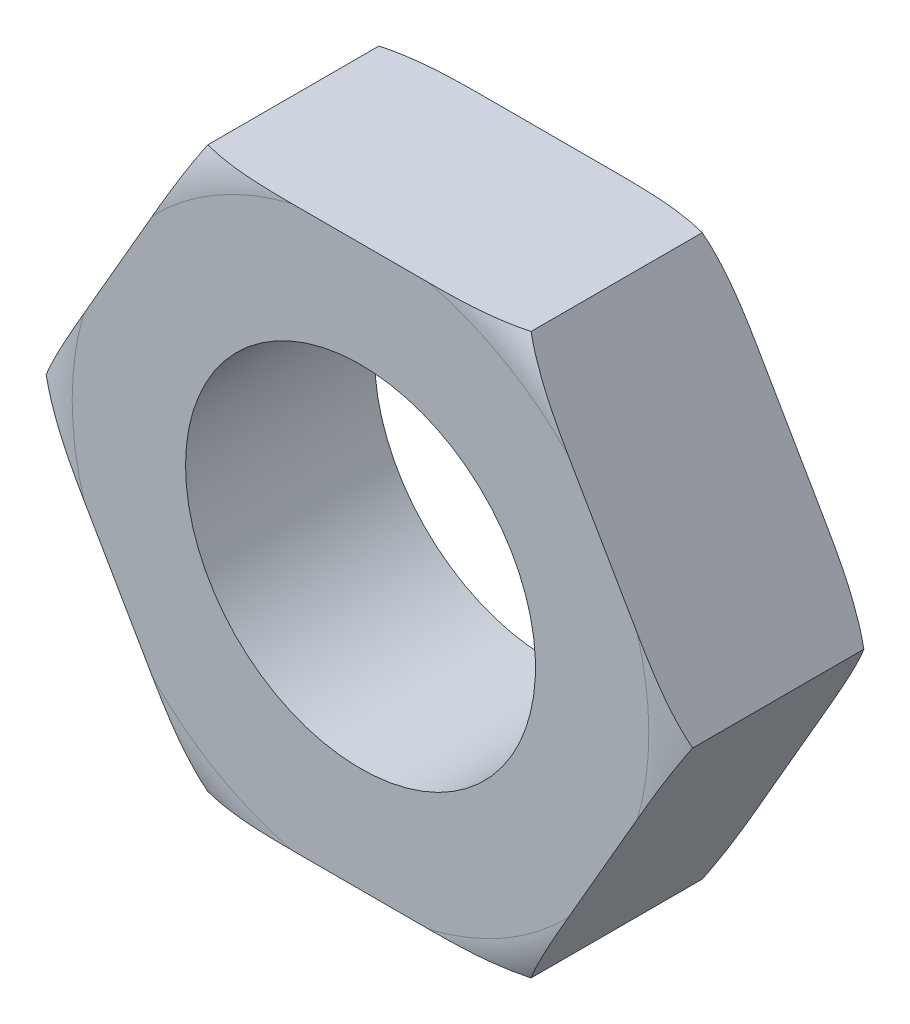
ISO-10303-21;
HEADER;
FILE_DESCRIPTION(('STEP AP214'),'2;1');
FILE_NAME('part.step','',(''),(''),'','','');
FILE_SCHEMA(('AUTOMOTIVE_DESIGN { 1 0 10303 214 1 1 1 1 }'));
ENDSEC;
DATA;
#1=APPLICATION_CONTEXT('core data for automotive mechanical design processes');
#2=APPLICATION_PROTOCOL_DEFINITION('international standard','automotive_design',2000,#1);
#3=PRODUCT_CONTEXT('',#1,'mechanical');
#4=PRODUCT('Part','Part','',(#3));
#5=PRODUCT_RELATED_PRODUCT_CATEGORY('part','',(#4));
#6=PRODUCT_DEFINITION_FORMATION('','',#4);
#7=PRODUCT_DEFINITION_CONTEXT('part definition',#1,'design');
#8=PRODUCT_DEFINITION('design','',#6,#7);
#9=PRODUCT_DEFINITION_SHAPE('','',#8);
#10=(LENGTH_UNIT() NAMED_UNIT(*) SI_UNIT(.MILLI.,.METRE.));
#11=(NAMED_UNIT(*) PLANE_ANGLE_UNIT() SI_UNIT($,.RADIAN.));
#12=(NAMED_UNIT(*) SI_UNIT($,.STERADIAN.) SOLID_ANGLE_UNIT());
#13=UNCERTAINTY_MEASURE_WITH_UNIT(LENGTH_MEASURE(1.E-05),#10,'distance_accuracy_value','');
#14=(GEOMETRIC_REPRESENTATION_CONTEXT(3) GLOBAL_UNCERTAINTY_ASSIGNED_CONTEXT((#13)) GLOBAL_UNIT_ASSIGNED_CONTEXT((#10,
#11,#12)) REPRESENTATION_CONTEXT('',''));
#15=CARTESIAN_POINT('',(0.,0.,0.));
#16=DIRECTION('',(0.,0.,1.));
#17=DIRECTION('',(1.,0.,0.));
#18=AXIS2_PLACEMENT_3D('',#15,#16,#17);
#19=CARTESIAN_POINT('',(4.618802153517,0.,0.));
#20=DIRECTION('',(0.,0.,1.));
#21=DIRECTION('',(1.,0.,0.));
#22=AXIS2_PLACEMENT_3D('',#19,#20,#21);
#23=PLANE('',#22);
#24=CARTESIAN_POINT('',(0.,0.,0.));
#25=DIRECTION('',(0.,0.,1.));
#26=DIRECTION('',(1.,0.,0.));
#27=AXIS2_PLACEMENT_3D('',#24,#25,#26);
#28=CIRCLE('',#27,2.5);
#29=CARTESIAN_POINT('',(-2.5,0.,0.));
#30=VERTEX_POINT('',#29);
#31=EDGE_CURVE('E343',#30,#30,#28,.T.);
#32=ORIENTED_EDGE('',*,*,#31,.T.);
#33=EDGE_LOOP('',(#32));
#34=FACE_BOUND('',#33,.T.);
#35=CARTESIAN_POINT('',(0.,0.,0.));
#36=DIRECTION('',(0.,0.,1.));
#37=DIRECTION('',(1.,0.,0.));
#38=AXIS2_PLACEMENT_3D('',#35,#36,#37);
#39=CIRCLE('',#38,4.11939562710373);
#40=CARTESIAN_POINT('',(-2.97180588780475,-2.85268121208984,0.));
#41=VERTEX_POINT('',#40);
#42=CARTESIAN_POINT('',(-0.984591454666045,-3.99999999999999,0.));
#43=VERTEX_POINT('',#42);
#44=EDGE_CURVE('E400',#41,#43,#39,.T.);
#45=ORIENTED_EDGE('',*,*,#44,.F.);
#46=DIRECTION('',(0.500000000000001,-0.866025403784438,0.));
#47=VECTOR('',#46,1.);
#48=CARTESIAN_POINT('',(-4.61880215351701,0.,0.));
#49=LINE('',#48,#47);
#50=CARTESIAN_POINT('',(-3.95639734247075,-1.14731878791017,0.));
#51=VERTEX_POINT('',#50);
#52=EDGE_CURVE('E192',#51,#41,#49,.T.);
#53=ORIENTED_EDGE('',*,*,#52,.F.);
#54=CARTESIAN_POINT('',(-3.95639734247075,1.14731878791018,0.));
#55=VERTEX_POINT('',#54);
#56=EDGE_CURVE('E398',#55,#51,#39,.T.);
#57=ORIENTED_EDGE('',*,*,#56,.F.);
#58=DIRECTION('',(-0.500000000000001,-0.866025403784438,0.));
#59=VECTOR('',#58,1.);
#60=CARTESIAN_POINT('',(-2.3094010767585,4.,0.));
#61=LINE('',#60,#59);
#62=CARTESIAN_POINT('',(-2.97180588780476,2.85268121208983,0.));
#63=VERTEX_POINT('',#62);
#64=EDGE_CURVE('E183',#63,#55,#61,.T.);
#65=ORIENTED_EDGE('',*,*,#64,.F.);
#66=CARTESIAN_POINT('',(-0.984591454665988,4.,0.));
#67=VERTEX_POINT('',#66);
#68=EDGE_CURVE('E177',#67,#63,#39,.T.);
#69=ORIENTED_EDGE('',*,*,#68,.F.);
#70=DIRECTION('',(-1.,0.,0.));
#71=VECTOR('',#70,1.);
#72=CARTESIAN_POINT('',(2.30940107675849,4.,0.));
#73=LINE('',#72,#71);
#74=CARTESIAN_POINT('',(0.984591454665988,4.,0.));
#75=VERTEX_POINT('',#74);
#76=EDGE_CURVE('E175',#75,#67,#73,.T.);
#77=ORIENTED_EDGE('',*,*,#76,.F.);
#78=CARTESIAN_POINT('',(2.97180588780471,2.85268121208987,0.));
#79=VERTEX_POINT('',#78);
#80=EDGE_CURVE('E59',#79,#75,#39,.T.);
#81=ORIENTED_EDGE('',*,*,#80,.F.);
#82=DIRECTION('',(-0.499999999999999,0.866025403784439,0.));
#83=VECTOR('',#82,1.);
#84=CARTESIAN_POINT('',(4.618802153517,0.,0.));
#85=LINE('',#84,#83);
#86=CARTESIAN_POINT('',(3.95639734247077,1.1473187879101,0.));
#87=VERTEX_POINT('',#86);
#88=EDGE_CURVE('E172',#87,#79,#85,.T.);
#89=ORIENTED_EDGE('',*,*,#88,.F.);
#90=CARTESIAN_POINT('',(3.95639734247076,-1.14731878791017,0.));
#91=VERTEX_POINT('',#90);
#92=EDGE_CURVE('E51',#91,#87,#39,.T.);
#93=ORIENTED_EDGE('',*,*,#92,.F.);
#94=DIRECTION('',(0.5,0.866025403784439,0.));
#95=VECTOR('',#94,1.);
#96=CARTESIAN_POINT('',(2.30940107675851,-3.99999999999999,0.));
#97=LINE('',#96,#95);
#98=CARTESIAN_POINT('',(2.97180588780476,-2.85268121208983,0.));
#99=VERTEX_POINT('',#98);
#100=EDGE_CURVE('E181',#99,#91,#97,.T.);
#101=ORIENTED_EDGE('',*,*,#100,.F.);
#102=CARTESIAN_POINT('',(0.984591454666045,-3.99999999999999,0.));
#103=VERTEX_POINT('',#102);
#104=EDGE_CURVE('E401',#103,#99,#39,.T.);
#105=ORIENTED_EDGE('',*,*,#104,.F.);
#106=DIRECTION('',(1.,0.,0.));
#107=VECTOR('',#106,1.);
#108=CARTESIAN_POINT('',(-2.3094010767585,-3.99999999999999,0.));
#109=LINE('',#108,#107);
#110=EDGE_CURVE('E195',#43,#103,#109,.T.);
#111=ORIENTED_EDGE('',*,*,#110,.F.);
#112=EDGE_LOOP('',(#45,#53,#57,#65,#69,#77,#81,#89,#93,#101,#105,#111));
#113=FACE_BOUND('',#112,.T.);
#114=ADVANCED_FACE('F31',(#34,#113),#23,.F.);
#115=CARTESIAN_POINT('',(4.618802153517,0.,2.7));
#116=DIRECTION('',(0.,0.,1.));
#117=DIRECTION('',(1.,0.,0.));
#118=AXIS2_PLACEMENT_3D('',#115,#116,#117);
#119=PLANE('',#118);
#120=CARTESIAN_POINT('',(0.,0.,2.7));
#121=DIRECTION('',(0.,0.,1.));
#122=DIRECTION('',(1.,0.,0.));
#123=AXIS2_PLACEMENT_3D('',#120,#121,#122);
#124=CIRCLE('',#123,4.11939562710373);
#125=CARTESIAN_POINT('',(0.984591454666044,-3.99999999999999,2.7));
#126=VERTEX_POINT('',#125);
#127=CARTESIAN_POINT('',(2.97180588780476,-2.85268121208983,2.7));
#128=VERTEX_POINT('',#127);
#129=EDGE_CURVE('E298',#126,#128,#124,.T.);
#130=ORIENTED_EDGE('',*,*,#129,.T.);
#131=DIRECTION('',(0.5,0.866025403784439,0.));
#132=VECTOR('',#131,1.);
#133=CARTESIAN_POINT('',(2.30940107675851,-3.99999999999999,2.7));
#134=LINE('',#133,#132);
#135=CARTESIAN_POINT('',(3.95639734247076,-1.14731878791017,2.7));
#136=VERTEX_POINT('',#135);
#137=EDGE_CURVE('E198',#128,#136,#134,.T.);
#138=ORIENTED_EDGE('',*,*,#137,.T.);
#139=CARTESIAN_POINT('',(3.95639734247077,1.1473187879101,2.7));
#140=VERTEX_POINT('',#139);
#141=EDGE_CURVE('E296',#136,#140,#124,.T.);
#142=ORIENTED_EDGE('',*,*,#141,.T.);
#143=DIRECTION('',(-0.499999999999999,0.866025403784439,0.));
#144=VECTOR('',#143,1.);
#145=CARTESIAN_POINT('',(4.618802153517,0.,2.7));
#146=LINE('',#145,#144);
#147=CARTESIAN_POINT('',(2.97180588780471,2.85268121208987,2.7));
#148=VERTEX_POINT('',#147);
#149=EDGE_CURVE('E340',#140,#148,#146,.T.);
#150=ORIENTED_EDGE('',*,*,#149,.T.);
#151=CARTESIAN_POINT('',(0.984591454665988,4.,2.7));
#152=VERTEX_POINT('',#151);
#153=EDGE_CURVE('E300',#148,#152,#124,.T.);
#154=ORIENTED_EDGE('',*,*,#153,.T.);
#155=DIRECTION('',(-1.,0.,0.));
#156=VECTOR('',#155,1.);
#157=CARTESIAN_POINT('',(2.30940107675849,4.,2.7));
#158=LINE('',#157,#156);
#159=CARTESIAN_POINT('',(-0.984591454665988,4.,2.7));
#160=VERTEX_POINT('',#159);
#161=EDGE_CURVE('E338',#152,#160,#158,.T.);
#162=ORIENTED_EDGE('',*,*,#161,.T.);
#163=CARTESIAN_POINT('',(-2.97180588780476,2.85268121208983,2.7));
#164=VERTEX_POINT('',#163);
#165=EDGE_CURVE('E310',#160,#164,#124,.T.);
#166=ORIENTED_EDGE('',*,*,#165,.T.);
#167=DIRECTION('',(-0.500000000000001,-0.866025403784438,0.));
#168=VECTOR('',#167,1.);
#169=CARTESIAN_POINT('',(-2.3094010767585,4.,2.7));
#170=LINE('',#169,#168);
#171=CARTESIAN_POINT('',(-3.95639734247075,1.14731878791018,2.7));
#172=VERTEX_POINT('',#171);
#173=EDGE_CURVE('E334',#164,#172,#170,.T.);
#174=ORIENTED_EDGE('',*,*,#173,.T.);
#175=CARTESIAN_POINT('',(-3.95639734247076,-1.14731878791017,2.7));
#176=VERTEX_POINT('',#175);
#177=EDGE_CURVE('E316',#172,#176,#124,.T.);
#178=ORIENTED_EDGE('',*,*,#177,.T.);
#179=DIRECTION('',(0.500000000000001,-0.866025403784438,0.));
#180=VECTOR('',#179,1.);
#181=CARTESIAN_POINT('',(-4.61880215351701,0.,2.7));
#182=LINE('',#181,#180);
#183=CARTESIAN_POINT('',(-2.97180588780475,-2.85268121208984,2.7));
#184=VERTEX_POINT('',#183);
#185=EDGE_CURVE('E327',#176,#184,#182,.T.);
#186=ORIENTED_EDGE('',*,*,#185,.T.);
#187=CARTESIAN_POINT('',(-0.984591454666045,-3.99999999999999,2.7));
#188=VERTEX_POINT('',#187);
#189=EDGE_CURVE('E306',#184,#188,#124,.T.);
#190=ORIENTED_EDGE('',*,*,#189,.T.);
#191=DIRECTION('',(1.,0.,0.));
#192=VECTOR('',#191,1.);
#193=CARTESIAN_POINT('',(-2.3094010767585,-3.99999999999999,2.7));
#194=LINE('',#193,#192);
#195=EDGE_CURVE('E203',#188,#126,#194,.T.);
#196=ORIENTED_EDGE('',*,*,#195,.T.);
#197=EDGE_LOOP('',(#130,#138,#142,#150,#154,#162,#166,#174,#178,#186,#190,#196));
#198=FACE_BOUND('',#197,.T.);
#199=CARTESIAN_POINT('',(0.,0.,2.7));
#200=DIRECTION('',(0.,0.,1.));
#201=DIRECTION('',(1.,0.,0.));
#202=AXIS2_PLACEMENT_3D('',#199,#200,#201);
#203=CIRCLE('',#202,2.5);
#204=CARTESIAN_POINT('',(-2.5,0.,2.7));
#205=VERTEX_POINT('',#204);
#206=EDGE_CURVE('E186',#205,#205,#203,.T.);
#207=ORIENTED_EDGE('',*,*,#206,.F.);
#208=EDGE_LOOP('',(#207));
#209=FACE_BOUND('',#208,.T.);
#210=ADVANCED_FACE('F325',(#198,#209),#119,.T.);
#211=CARTESIAN_POINT('',(2.30940107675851,-3.99999999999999,2.7));
#212=DIRECTION('',(-0.866025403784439,0.5,0.));
#213=DIRECTION('',(-0.5,-0.866025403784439,0.));
#214=AXIS2_PLACEMENT_3D('',#211,#212,#213);
#215=PLANE('',#214);
#216=DIRECTION('',(0.,0.,-1.));
#217=VECTOR('',#216,1.);
#218=CARTESIAN_POINT('',(2.30940107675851,-3.99999999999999,2.7));
#219=LINE('',#218,#217);
#220=CARTESIAN_POINT('',(2.30940107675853,-3.99999999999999,2.573));
#221=VERTEX_POINT('',#220);
#222=CARTESIAN_POINT('',(2.30940107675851,-3.99999999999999,0.126999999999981));
#223=VERTEX_POINT('',#222);
#224=EDGE_CURVE('E199',#221,#223,#219,.T.);
#225=ORIENTED_EDGE('',*,*,#224,.T.);
#226=CARTESIAN_POINT('',(2.30928560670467,-4.00019999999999,0.127062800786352));
#227=CARTESIAN_POINT('',(2.34600841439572,-3.93659423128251,0.107135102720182));
#228=CARTESIAN_POINT('',(2.38311911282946,-3.87231661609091,0.090462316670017));
#229=CARTESIAN_POINT('',(2.45776959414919,-3.74301818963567,0.0624673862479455));
#230=CARTESIAN_POINT('',(2.49530832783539,-3.67799919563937,0.0511342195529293));
#231=CARTESIAN_POINT('',(2.57035821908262,-3.54800897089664,0.0326517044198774));
#232=CARTESIAN_POINT('',(2.60786771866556,-3.48304061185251,0.0254735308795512));
#233=CARTESIAN_POINT('',(2.68302017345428,-3.35287274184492,0.0142185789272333));
#234=CARTESIAN_POINT('',(2.72066319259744,-3.28767312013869,0.0101435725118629));
#235=CARTESIAN_POINT('',(2.83334633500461,-3.09250019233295,0.00129263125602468));
#236=CARTESIAN_POINT('',(2.90844312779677,-2.96242873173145,-0.000168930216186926));
#237=CARTESIAN_POINT('',(3.05874749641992,-2.7020939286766,0.000198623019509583));
#238=CARTESIAN_POINT('',(3.13395501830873,-2.57183067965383,0.00203386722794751));
#239=CARTESIAN_POINT('',(3.26792243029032,-2.3397923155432,0.00487501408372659));
#240=CARTESIAN_POINT('',(3.32668094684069,-2.23801957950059,0.00597451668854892));
#241=CARTESIAN_POINT('',(3.44419194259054,-2.03448456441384,0.00700445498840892));
#242=CARTESIAN_POINT('',(3.50294442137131,-1.93272228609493,0.0069350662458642));
#243=CARTESIAN_POINT('',(3.62035144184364,-1.72936736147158,0.00567451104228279));
#244=CARTESIAN_POINT('',(3.67900598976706,-1.62777470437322,0.00448514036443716));
#245=CARTESIAN_POINT('',(3.79634201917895,-1.42454273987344,0.00197999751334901));
#246=CARTESIAN_POINT('',(3.85502350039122,-1.32290343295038,0.000664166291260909));
#247=CARTESIAN_POINT('',(3.97271169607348,-1.11906149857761,-0.000300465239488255));
#248=CARTESIAN_POINT('',(4.03171844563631,-1.01685881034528,5.98290298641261E-05));
#249=CARTESIAN_POINT('',(4.14963679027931,-0.812618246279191,0.0049476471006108));
#250=CARTESIAN_POINT('',(4.2085484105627,-0.710580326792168,0.00946984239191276));
#251=CARTESIAN_POINT('',(4.29689466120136,-0.557560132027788,0.0217220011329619));
#252=CARTESIAN_POINT('',(4.32642026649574,-0.506420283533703,0.0267387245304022));
#253=CARTESIAN_POINT('',(4.38534374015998,-0.40436183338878,0.0390728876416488));
#254=CARTESIAN_POINT('',(4.41474164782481,-0.353443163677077,0.0463895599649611));
#255=CARTESIAN_POINT('',(4.47347028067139,-0.25172218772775,0.0638665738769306));
#256=CARTESIAN_POINT('',(4.50280008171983,-0.200921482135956,0.0740397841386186));
#257=CARTESIAN_POINT('',(4.56114309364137,-0.0998684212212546,0.097822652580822));
#258=CARTESIAN_POINT('',(4.59015587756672,-0.0496168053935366,0.111436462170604));
#259=CARTESIAN_POINT('',(4.61891762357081,0.000199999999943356,0.127062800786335));
#260=B_SPLINE_CURVE_WITH_KNOTS('',3,(#226,#227,#228,#229,#230,#231,#232,#233,#234,#235,#236,
#237,#238,#239,#240,#241,#242,#243,#244,#245,#246,#247,#248,#249,#250,#251,#252,#253,#254,#255,
#256,#257,#258,#259),.UNSPECIFIED.,.F.,.F.,(4,2,2,2,2,2,2,2,2,2,2,2,2,2,2,2,4),(0.,
0.228081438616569,0.455689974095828,0.681699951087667,0.907838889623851,1.35829623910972,
1.80959195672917,2.16215314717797,2.51466138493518,2.86660537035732,3.21871449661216,
3.57273637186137,3.92630562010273,4.10406116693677,4.28175746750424,4.46026749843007,
4.63899395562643),.UNSPECIFIED.);
#261=EDGE_CURVE('E308',#223,#99,#260,.T.);
#262=ORIENTED_EDGE('',*,*,#261,.T.);
#263=ORIENTED_EDGE('',*,*,#100,.T.);
#264=CARTESIAN_POINT('',(4.61880215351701,0.,0.127));
#265=VERTEX_POINT('',#264);
#266=EDGE_CURVE('E299',#91,#265,#260,.T.);
#267=ORIENTED_EDGE('',*,*,#266,.T.);
#268=DIRECTION('',(0.,0.,-1.));
#269=VECTOR('',#268,1.);
#270=CARTESIAN_POINT('',(4.618802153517,0.,2.7));
#271=LINE('',#270,#269);
#272=CARTESIAN_POINT('',(4.618802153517,0.,2.57300000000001));
#273=VERTEX_POINT('',#272);
#274=EDGE_CURVE('E214',#273,#265,#271,.T.);
#275=ORIENTED_EDGE('',*,*,#274,.F.);
#276=CARTESIAN_POINT('',(4.61891762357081,0.000199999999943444,2.57293719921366));
#277=CARTESIAN_POINT('',(4.58219481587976,-0.0634057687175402,2.59286489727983));
#278=CARTESIAN_POINT('',(4.54508411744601,-0.127683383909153,2.60953768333));
#279=CARTESIAN_POINT('',(4.47043363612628,-0.25698181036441,2.63753261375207));
#280=CARTESIAN_POINT('',(4.43289490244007,-0.322000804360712,2.64886578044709));
#281=CARTESIAN_POINT('',(4.35784501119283,-0.451991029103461,2.66734829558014));
#282=CARTESIAN_POINT('',(4.32033551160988,-0.516959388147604,2.67452646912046));
#283=CARTESIAN_POINT('',(4.24518305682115,-0.647127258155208,2.68578142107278));
#284=CARTESIAN_POINT('',(4.20754003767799,-0.712326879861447,2.68985642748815));
#285=CARTESIAN_POINT('',(4.09485689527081,-0.907499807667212,2.69870736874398));
#286=CARTESIAN_POINT('',(4.01976010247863,-1.03757126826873,2.70016893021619));
#287=CARTESIAN_POINT('',(3.86945573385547,-1.29790607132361,2.69980137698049));
#288=CARTESIAN_POINT('',(3.79424821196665,-1.4281693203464,2.69796613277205));
#289=CARTESIAN_POINT('',(3.66028079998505,-1.66020768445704,2.69512498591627));
#290=CARTESIAN_POINT('',(3.60152228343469,-1.76198042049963,2.69402548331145));
#291=CARTESIAN_POINT('',(3.48401128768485,-1.96551543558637,2.69299554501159));
#292=CARTESIAN_POINT('',(3.42525880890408,-2.06727771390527,2.69306493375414));
#293=CARTESIAN_POINT('',(3.30785178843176,-2.27063263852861,2.69432548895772));
#294=CARTESIAN_POINT('',(3.24919724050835,-2.37222529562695,2.69551485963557));
#295=CARTESIAN_POINT('',(3.13186121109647,-2.57545726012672,2.69802000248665));
#296=CARTESIAN_POINT('',(3.0731797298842,-2.67709656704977,2.69933583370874));
#297=CARTESIAN_POINT('',(2.95549153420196,-2.88093850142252,2.70030046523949));
#298=CARTESIAN_POINT('',(2.89648478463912,-2.98314118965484,2.69994017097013));
#299=CARTESIAN_POINT('',(2.77856643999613,-3.18738175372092,2.69505235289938));
#300=CARTESIAN_POINT('',(2.71965481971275,-3.28941967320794,2.69053015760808));
#301=CARTESIAN_POINT('',(2.6313085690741,-3.4424398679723,2.67827799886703));
#302=CARTESIAN_POINT('',(2.60178296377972,-3.49357971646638,2.67326127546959));
#303=CARTESIAN_POINT('',(2.54285949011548,-3.5956381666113,2.66092711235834));
#304=CARTESIAN_POINT('',(2.51346158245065,-3.646556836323,2.65361044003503));
#305=CARTESIAN_POINT('',(2.45473294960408,-3.74827781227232,2.63613342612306));
#306=CARTESIAN_POINT('',(2.42540314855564,-3.79907851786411,2.62596021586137));
#307=CARTESIAN_POINT('',(2.36706013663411,-3.9001315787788,2.60217734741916));
#308=CARTESIAN_POINT('',(2.33804735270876,-3.95038319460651,2.58856353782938));
#309=CARTESIAN_POINT('',(2.30928560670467,-4.00019999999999,2.57293719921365));
#310=B_SPLINE_CURVE_WITH_KNOTS('',3,(#276,#277,#278,#279,#280,#281,#282,#283,#284,#285,#286,
#287,#288,#289,#290,#291,#292,#293,#294,#295,#296,#297,#298,#299,#300,#301,#302,#303,#304,#305,
#306,#307,#308,#309),.UNSPECIFIED.,.F.,.F.,(4,2,2,2,2,2,2,2,2,2,2,2,2,2,2,2,4),(0.,
0.228081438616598,0.455689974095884,0.681699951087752,0.907838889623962,1.35829623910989,
1.80959195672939,2.16215314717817,2.51466138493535,2.86660537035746,3.21871449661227,
3.57273637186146,3.92630562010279,4.10406116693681,4.28175746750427,4.46026749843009,
4.63899395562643),.UNSPECIFIED.);
#311=EDGE_CURVE('E314',#273,#136,#310,.T.);
#312=ORIENTED_EDGE('',*,*,#311,.T.);
#313=ORIENTED_EDGE('',*,*,#137,.F.);
#314=EDGE_CURVE('E243',#128,#221,#310,.T.);
#315=ORIENTED_EDGE('',*,*,#314,.T.);
#316=EDGE_LOOP('',(#225,#262,#263,#267,#275,#312,#313,#315));
#317=FACE_BOUND('',#316,.T.);
#318=ADVANCED_FACE('F33',(#317),#215,.F.);
#319=CARTESIAN_POINT('',(4.618802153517,0.,2.7));
#320=DIRECTION('',(-0.866025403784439,-0.499999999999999,0.));
#321=DIRECTION('',(0.499999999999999,-0.866025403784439,0.));
#322=AXIS2_PLACEMENT_3D('',#319,#320,#321);
#323=PLANE('',#322);
#324=ORIENTED_EDGE('',*,*,#274,.T.);
#325=CARTESIAN_POINT('',(4.61891762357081,-0.000199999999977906,0.127062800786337));
#326=CARTESIAN_POINT('',(4.58219481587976,0.0634057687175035,0.107135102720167));
#327=CARTESIAN_POINT('',(4.54508411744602,0.127683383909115,0.0904623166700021));
#328=CARTESIAN_POINT('',(4.47043363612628,0.256981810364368,0.0624673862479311));
#329=CARTESIAN_POINT('',(4.43289490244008,0.322000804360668,0.0511342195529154));
#330=CARTESIAN_POINT('',(4.35784501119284,0.451991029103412,0.0326517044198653));
#331=CARTESIAN_POINT('',(4.32033551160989,0.516959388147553,0.0254735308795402));
#332=CARTESIAN_POINT('',(4.24518305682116,0.647127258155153,0.0142185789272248));
#333=CARTESIAN_POINT('',(4.20754003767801,0.71232687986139,0.0101435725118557));
#334=CARTESIAN_POINT('',(4.09485689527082,0.907499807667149,0.00129263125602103));
#335=CARTESIAN_POINT('',(4.01976010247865,1.03757126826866,-0.000168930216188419));
#336=CARTESIAN_POINT('',(3.8694557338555,1.29790607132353,0.000198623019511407));
#337=CARTESIAN_POINT('',(3.79424821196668,1.42816932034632,0.00203386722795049));
#338=CARTESIAN_POINT('',(3.66028079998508,1.66020768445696,0.00487501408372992));
#339=CARTESIAN_POINT('',(3.60152228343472,1.76198042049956,0.00597451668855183));
#340=CARTESIAN_POINT('',(3.48401128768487,1.9655154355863,0.00700445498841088));
#341=CARTESIAN_POINT('',(3.4252588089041,2.06727771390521,0.00693506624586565));
#342=CARTESIAN_POINT('',(3.30785178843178,2.27063263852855,0.00567451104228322));
#343=CARTESIAN_POINT('',(3.24919724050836,2.3722252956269,0.00448514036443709));
#344=CARTESIAN_POINT('',(3.13186121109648,2.57545726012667,0.00197999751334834));
#345=CARTESIAN_POINT('',(3.07317972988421,2.67709656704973,0.000664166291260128));
#346=CARTESIAN_POINT('',(2.95549153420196,2.88093850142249,-0.000300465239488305));
#347=CARTESIAN_POINT('',(2.89648478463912,2.98314118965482,5.9829029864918E-05));
#348=CARTESIAN_POINT('',(2.77856643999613,3.1873817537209,0.00494764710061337));
#349=CARTESIAN_POINT('',(2.71965481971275,3.28941967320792,0.00946984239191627));
#350=CARTESIAN_POINT('',(2.63130856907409,3.44243986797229,0.0217220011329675));
#351=CARTESIAN_POINT('',(2.60178296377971,3.49357971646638,0.0267387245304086));
#352=CARTESIAN_POINT('',(2.54285949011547,3.5956381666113,0.0390728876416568));
#353=CARTESIAN_POINT('',(2.51346158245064,3.646556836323,0.0463895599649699));
#354=CARTESIAN_POINT('',(2.45473294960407,3.74827781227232,0.0638665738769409));
#355=CARTESIAN_POINT('',(2.42540314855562,3.79907851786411,0.0740397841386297));
#356=CARTESIAN_POINT('',(2.36706013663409,3.90013157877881,0.0978226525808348));
#357=CARTESIAN_POINT('',(2.33804735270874,3.95038319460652,0.111436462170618));
#358=CARTESIAN_POINT('',(2.30928560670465,4.0002,0.12706280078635));
#359=B_SPLINE_CURVE_WITH_KNOTS('',3,(#325,#326,#327,#328,#329,#330,#331,#332,#333,#334,#335,
#336,#337,#338,#339,#340,#341,#342,#343,#344,#345,#346,#347,#348,#349,#350,#351,#352,#353,#354,
#355,#356,#357,#358),.UNSPECIFIED.,.F.,.F.,(4,2,2,2,2,2,2,2,2,2,2,2,2,2,2,2,4),(0.,
0.228081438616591,0.45568997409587,0.681699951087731,0.907838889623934,1.35829623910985,
1.80959195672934,2.16215314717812,2.51466138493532,2.86660537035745,3.21871449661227,
3.57273637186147,3.92630562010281,4.10406116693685,4.28175746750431,4.46026749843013,
4.63899395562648),.UNSPECIFIED.);
#360=EDGE_CURVE('E166',#265,#87,#359,.T.);
#361=ORIENTED_EDGE('',*,*,#360,.T.);
#362=ORIENTED_EDGE('',*,*,#88,.T.);
#363=CARTESIAN_POINT('',(2.3094010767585,4.,0.127));
#364=VERTEX_POINT('',#363);
#365=EDGE_CURVE('E159',#79,#364,#359,.T.);
#366=ORIENTED_EDGE('',*,*,#365,.T.);
#367=DIRECTION('',(0.,0.,-1.));
#368=VECTOR('',#367,1.);
#369=CARTESIAN_POINT('',(2.30940107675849,4.,2.7));
#370=LINE('',#369,#368);
#371=CARTESIAN_POINT('',(2.30940107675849,4.,2.57300000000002));
#372=VERTEX_POINT('',#371);
#373=EDGE_CURVE('E212',#372,#364,#370,.T.);
#374=ORIENTED_EDGE('',*,*,#373,.F.);
#375=CARTESIAN_POINT('',(2.30928560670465,4.0002,2.57293719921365));
#376=CARTESIAN_POINT('',(2.34600841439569,3.93659423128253,2.59286489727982));
#377=CARTESIAN_POINT('',(2.38311911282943,3.87231661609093,2.60953768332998));
#378=CARTESIAN_POINT('',(2.45776959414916,3.74301818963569,2.63753261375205));
#379=CARTESIAN_POINT('',(2.49530832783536,3.6779991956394,2.64886578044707));
#380=CARTESIAN_POINT('',(2.57035821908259,3.54800897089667,2.66734829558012));
#381=CARTESIAN_POINT('',(2.60786771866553,3.48304061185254,2.67452646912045));
#382=CARTESIAN_POINT('',(2.68302017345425,3.35287274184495,2.68578142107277));
#383=CARTESIAN_POINT('',(2.7206631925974,3.28767312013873,2.68985642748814));
#384=CARTESIAN_POINT('',(2.83334633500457,3.09250019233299,2.69870736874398));
#385=CARTESIAN_POINT('',(2.90844312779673,2.9624287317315,2.70016893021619));
#386=CARTESIAN_POINT('',(3.05874749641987,2.70209392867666,2.69980137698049));
#387=CARTESIAN_POINT('',(3.13395501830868,2.57183067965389,2.69796613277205));
#388=CARTESIAN_POINT('',(3.26792243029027,2.33979231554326,2.69512498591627));
#389=CARTESIAN_POINT('',(3.32668094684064,2.23801957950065,2.69402548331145));
#390=CARTESIAN_POINT('',(3.4441919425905,2.03448456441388,2.69299554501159));
#391=CARTESIAN_POINT('',(3.50294442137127,1.93272228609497,2.69306493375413));
#392=CARTESIAN_POINT('',(3.6203514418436,1.72936736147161,2.69432548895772));
#393=CARTESIAN_POINT('',(3.67900598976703,1.62777470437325,2.69551485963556));
#394=CARTESIAN_POINT('',(3.79634201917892,1.42454273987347,2.69802000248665));
#395=CARTESIAN_POINT('',(3.85502350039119,1.3229034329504,2.69933583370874));
#396=CARTESIAN_POINT('',(3.97271169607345,1.11906149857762,2.70030046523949));
#397=CARTESIAN_POINT('',(4.03171844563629,1.01685881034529,2.69994017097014));
#398=CARTESIAN_POINT('',(4.1496367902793,0.812618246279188,2.69505235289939));
#399=CARTESIAN_POINT('',(4.20854841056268,0.710580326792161,2.69053015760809));
#400=CARTESIAN_POINT('',(4.29689466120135,0.557560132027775,2.67827799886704));
#401=CARTESIAN_POINT('',(4.32642026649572,0.506420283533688,2.6732612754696));
#402=CARTESIAN_POINT('',(4.38534374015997,0.404361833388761,2.66092711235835));
#403=CARTESIAN_POINT('',(4.4147416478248,0.353443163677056,2.65361044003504));
#404=CARTESIAN_POINT('',(4.47347028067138,0.251722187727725,2.63613342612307));
#405=CARTESIAN_POINT('',(4.50280008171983,0.200921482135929,2.62596021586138));
#406=CARTESIAN_POINT('',(4.56114309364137,0.0998684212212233,2.60217734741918));
#407=CARTESIAN_POINT('',(4.59015587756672,0.0496168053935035,2.5885635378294));
#408=CARTESIAN_POINT('',(4.61891762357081,-0.000199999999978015,2.57293719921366));
#409=B_SPLINE_CURVE_WITH_KNOTS('',3,(#375,#376,#377,#378,#379,#380,#381,#382,#383,#384,#385,
#386,#387,#388,#389,#390,#391,#392,#393,#394,#395,#396,#397,#398,#399,#400,#401,#402,#403,#404,
#405,#406,#407,#408),.UNSPECIFIED.,.F.,.F.,(4,2,2,2,2,2,2,2,2,2,2,2,2,2,2,2,4),(0.,
0.228081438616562,0.455689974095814,0.681699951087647,0.907838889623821,1.35829623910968,
1.80959195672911,2.16215314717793,2.51466138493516,2.86660537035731,3.21871449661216,
3.57273637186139,3.92630562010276,4.10406116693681,4.28175746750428,4.46026749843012,
4.63899395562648),.UNSPECIFIED.);
#410=EDGE_CURVE('E268',#372,#148,#409,.T.);
#411=ORIENTED_EDGE('',*,*,#410,.T.);
#412=ORIENTED_EDGE('',*,*,#149,.F.);
#413=EDGE_CURVE('E545',#140,#273,#409,.T.);
#414=ORIENTED_EDGE('',*,*,#413,.T.);
#415=EDGE_LOOP('',(#324,#361,#362,#366,#374,#411,#412,#414));
#416=FACE_BOUND('',#415,.T.);
#417=ADVANCED_FACE('F180',(#416),#323,.F.);
#418=CARTESIAN_POINT('',(2.30940107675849,4.,2.7));
#419=DIRECTION('',(0.,-1.,0.));
#420=DIRECTION('',(0.,0.,-1.));
#421=AXIS2_PLACEMENT_3D('',#418,#419,#420);
#422=PLANE('',#421);
#423=ORIENTED_EDGE('',*,*,#76,.T.);
#424=CARTESIAN_POINT('',(0.,4.,0.00684038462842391));
#425=CARTESIAN_POINT('',(-0.0875168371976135,4.,0.00683947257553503));
#426=CARTESIAN_POINT('',(-0.175033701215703,4.,0.00649747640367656));
#427=CARTESIAN_POINT('',(-0.350065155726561,4.,0.00527650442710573));
#428=CARTESIAN_POINT('',(-0.437579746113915,4.,0.00439751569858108));
#429=CARTESIAN_POINT('',(-0.612759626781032,4.,0.00253608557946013));
#430=CARTESIAN_POINT('',(-0.700424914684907,4.,0.00155346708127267));
#431=CARTESIAN_POINT('',(-0.875758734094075,4.,0.00017491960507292));
#432=CARTESIAN_POINT('',(-0.96342726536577,4.,-0.000221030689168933));
#433=CARTESIAN_POINT('',(-1.1382300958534,4.,0.000476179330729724));
#434=CARTESIAN_POINT('',(-1.22536439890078,4.,0.00156029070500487));
#435=CARTESIAN_POINT('',(-1.39956123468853,4.,0.00627520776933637));
#436=CARTESIAN_POINT('',(-1.4866237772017,4.,0.00990557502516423));
#437=CARTESIAN_POINT('',(-1.66029609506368,4.,0.0209540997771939));
#438=CARTESIAN_POINT('',(-1.74690645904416,4.,0.0283623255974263));
#439=CARTESIAN_POINT('',(-1.91950475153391,4.,0.0484042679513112));
#440=CARTESIAN_POINT('',(-2.00549306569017,4.,0.0610344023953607));
#441=CARTESIAN_POINT('',(-2.13747251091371,4.,0.0859205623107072));
#442=CARTESIAN_POINT('',(-2.18391788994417,4.,0.0957487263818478));
#443=CARTESIAN_POINT('',(-2.27624958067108,4.,0.117795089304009));
#444=CARTESIAN_POINT('',(-2.32213565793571,4.,0.130014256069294));
#445=CARTESIAN_POINT('',(-2.45860548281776,4.,0.170769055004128));
#446=CARTESIAN_POINT('',(-2.54806746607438,4.,0.203413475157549));
#447=CARTESIAN_POINT('',(-2.69802264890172,4.,0.272304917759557));
#448=CARTESIAN_POINT('',(-2.75996533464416,4.,0.305368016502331));
#449=CARTESIAN_POINT('',(-2.87822277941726,4.,0.380462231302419));
#450=CARTESIAN_POINT('',(-2.93454716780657,4.,0.42247760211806));
#451=CARTESIAN_POINT('',(-3.02254889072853,4.,0.502227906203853));
#452=CARTESIAN_POINT('',(-3.05652726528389,4.,0.537411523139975));
#453=CARTESIAN_POINT('',(-3.11857244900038,4.,0.612676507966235));
#454=CARTESIAN_POINT('',(-3.14664720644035,4.,0.652751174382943));
#455=CARTESIAN_POINT('',(-3.1909378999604,4.,0.730095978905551));
#456=CARTESIAN_POINT('',(-3.20836143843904,4.,0.766670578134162));
#457=CARTESIAN_POINT('',(-3.23688273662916,4.,0.842224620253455));
#458=CARTESIAN_POINT('',(-3.24798404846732,4.,0.881202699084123));
#459=CARTESIAN_POINT('',(-3.26309825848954,4.,0.960722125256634));
#460=CARTESIAN_POINT('',(-3.26707726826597,4.,1.00127001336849));
#461=CARTESIAN_POINT('',(-3.26751517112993,4.,1.08240560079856));
#462=CARTESIAN_POINT('',(-3.26397486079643,4.,1.12299329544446));
#463=CARTESIAN_POINT('',(-3.2502296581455,4.,1.19973915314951));
#464=CARTESIAN_POINT('',(-3.24056431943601,4.,1.23599636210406));
#465=CARTESIAN_POINT('',(-3.21571191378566,4.,1.30654421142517));
#466=CARTESIAN_POINT('',(-3.20052383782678,4.,1.34083449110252));
#467=CARTESIAN_POINT('',(-3.15970051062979,4.,1.41763868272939));
#468=CARTESIAN_POINT('',(-3.1322740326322,4.,1.45920003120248));
#469=CARTESIAN_POINT('',(-3.07102156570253,4.,1.53732298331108));
#470=CARTESIAN_POINT('',(-3.03718119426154,4.,1.57387302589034));
#471=CARTESIAN_POINT('',(-2.94921229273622,4.,1.65657795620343));
#472=CARTESIAN_POINT('',(-2.89262003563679,4.,1.70009716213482));
#473=CARTESIAN_POINT('',(-2.77349745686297,4.,1.77777169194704));
#474=CARTESIAN_POINT('',(-2.71096363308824,4.,1.81192144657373));
#475=CARTESIAN_POINT('',(-2.59166027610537,4.,1.86785188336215));
#476=CARTESIAN_POINT('',(-2.53538375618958,4.,1.89071082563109));
#477=CARTESIAN_POINT('',(-2.42103776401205,4.,1.93148436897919));
#478=CARTESIAN_POINT('',(-2.36296677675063,4.,1.94939465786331));
#479=CARTESIAN_POINT('',(-2.24543326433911,4.,1.98108900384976));
#480=CARTESIAN_POINT('',(-2.18596541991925,4.,1.99485295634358));
#481=CARTESIAN_POINT('',(-2.06638168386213,4.,2.01881859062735));
#482=CARTESIAN_POINT('',(-2.006266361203,4.,2.02902317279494));
#483=CARTESIAN_POINT('',(-1.81045569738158,4.,2.05742155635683));
#484=CARTESIAN_POINT('',(-1.67391989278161,4.,2.06972662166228));
#485=CARTESIAN_POINT('',(-1.40029826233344,4.,2.0854852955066));
#486=CARTESIAN_POINT('',(-1.26321191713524,4.,2.08892550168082));
#487=CARTESIAN_POINT('',(-0.988472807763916,4.,2.091500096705));
#488=CARTESIAN_POINT('',(-0.850819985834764,4.,2.09061708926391));
#489=CARTESIAN_POINT('',(-0.575629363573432,4.,2.0880153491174));
#490=CARTESIAN_POINT('',(-0.438091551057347,4.,2.08629721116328));
#491=CARTESIAN_POINT('',(-0.162519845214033,4.,2.08415417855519));
#492=CARTESIAN_POINT('',(-0.0244858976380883,4.,2.08373382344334));
#493=CARTESIAN_POINT('',(0.251618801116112,4.,2.08462085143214));
#494=CARTESIAN_POINT('',(0.389689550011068,4.,2.08592878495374));
#495=CARTESIAN_POINT('',(0.665563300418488,4.,2.08885723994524));
#496=CARTESIAN_POINT('',(0.8033663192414,4.,2.09047717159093));
#497=CARTESIAN_POINT('',(1.07896483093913,4.,2.09109140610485));
#498=CARTESIAN_POINT('',(1.21676030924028,4.,2.09008663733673));
#499=CARTESIAN_POINT('',(1.42548442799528,4.,2.08340318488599));
#500=CARTESIAN_POINT('',(1.49648311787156,4.,2.08022324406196));
#501=CARTESIAN_POINT('',(1.63835215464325,4.,2.07134688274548));
#502=CARTESIAN_POINT('',(1.70922245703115,4.,2.06564971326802));
#503=CARTESIAN_POINT('',(1.85043964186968,4.,2.05098369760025));
#504=CARTESIAN_POINT('',(1.92078743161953,4.,2.04202398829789));
#505=CARTESIAN_POINT('',(2.06081608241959,4.,2.01995199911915));
#506=CARTESIAN_POINT('',(2.13049717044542,4.,2.00684118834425));
#507=CARTESIAN_POINT('',(2.29381803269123,4.,1.9697784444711));
#508=CARTESIAN_POINT('',(2.38698025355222,4.,1.94361914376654));
#509=CARTESIAN_POINT('',(2.56902781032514,4.,1.8787234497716));
#510=CARTESIAN_POINT('',(2.6579159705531,4.,1.83999549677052));
#511=CARTESIAN_POINT('',(2.79570178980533,4.,1.76389043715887));
#512=CARTESIAN_POINT('',(2.84722949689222,4.,1.73131288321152));
#513=CARTESIAN_POINT('',(2.9450238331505,4.,1.65901122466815));
#514=CARTESIAN_POINT('',(2.9912991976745,4.,1.61929927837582));
#515=CARTESIAN_POINT('',(3.06655590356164,4.,1.54205125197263));
#516=CARTESIAN_POINT('',(3.09708610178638,4.,1.50603427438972));
#517=CARTESIAN_POINT('',(3.15196196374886,4.,1.42953230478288));
#518=CARTESIAN_POINT('',(3.17631458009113,4.,1.38905240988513));
#519=CARTESIAN_POINT('',(3.21378905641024,4.,1.31131174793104));
#520=CARTESIAN_POINT('',(3.22810304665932,4.,1.27462846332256));
#521=CARTESIAN_POINT('',(3.25038898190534,4.,1.19937548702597));
#522=CARTESIAN_POINT('',(3.2583647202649,4.,1.16080693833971));
#523=CARTESIAN_POINT('',(3.26741674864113,4.,1.08273164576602));
#524=CARTESIAN_POINT('',(3.26847080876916,4.,1.04322228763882));
#525=CARTESIAN_POINT('',(3.26353776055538,4.,0.9646477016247));
#526=CARTESIAN_POINT('',(3.25755003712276,4.,0.925582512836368));
#527=CARTESIAN_POINT('',(3.23943908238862,4.,0.850938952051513));
#528=CARTESIAN_POINT('',(3.22762825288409,4.,0.815283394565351));
#529=CARTESIAN_POINT('',(3.19875641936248,4.,0.746185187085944));
#530=CARTESIAN_POINT('',(3.18169363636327,4.,0.71274329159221));
#531=CARTESIAN_POINT('',(3.13566408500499,4.,0.636079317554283));
#532=CARTESIAN_POINT('',(3.10464653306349,4.,0.594088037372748));
#533=CARTESIAN_POINT('',(3.03623783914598,4.,0.51567153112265));
#534=CARTESIAN_POINT('',(2.99883365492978,4.,0.479257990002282));
#535=CARTESIAN_POINT('',(2.9010095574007,4.,0.396216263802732));
#536=CARTESIAN_POINT('',(2.83796722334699,4.,0.352696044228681));
#537=CARTESIAN_POINT('',(2.70601527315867,4.,0.275864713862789));
#538=CARTESIAN_POINT('',(2.63709501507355,4.,0.242572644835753));
#539=CARTESIAN_POINT('',(2.50374141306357,4.,0.187767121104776));
#540=CARTESIAN_POINT('',(2.43966869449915,4.,0.165352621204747));
#541=CARTESIAN_POINT('',(2.30980415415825,4.,0.126117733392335));
#542=CARTESIAN_POINT('',(2.24401085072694,4.,0.109302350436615));
#543=CARTESIAN_POINT('',(2.11132350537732,4.,0.0802700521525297));
#544=CARTESIAN_POINT('',(2.04442776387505,4.,0.068061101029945));
#545=CARTESIAN_POINT('',(1.91004663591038,4.,0.0474074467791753));
#546=CARTESIAN_POINT('',(1.84256102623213,4.,0.038964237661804));
#547=CARTESIAN_POINT('',(1.62796269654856,4.,0.0169003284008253));
#548=CARTESIAN_POINT('',(1.48030070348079,4.,0.00882330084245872));
#549=CARTESIAN_POINT('',(1.18471787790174,4.,0.000143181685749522));
#550=CARTESIAN_POINT('',(1.03679695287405,4.,-0.000450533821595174));
#551=CARTESIAN_POINT('',(0.814773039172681,4.,0.000567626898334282));
#552=CARTESIAN_POINT('',(0.740663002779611,4.,0.00122684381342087));
#553=CARTESIAN_POINT('',(0.592444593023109,4.,0.00272428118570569));
#554=CARTESIAN_POINT('',(0.518336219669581,4.,0.00356250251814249));
#555=CARTESIAN_POINT('',(0.370190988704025,4.,0.00505184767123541));
#556=CARTESIAN_POINT('',(0.296154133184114,4.,0.00570315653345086));
#557=CARTESIAN_POINT('',(0.148078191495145,4.,0.00659780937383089));
#558=CARTESIAN_POINT('',(0.0740391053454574,4.,0.00684115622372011));
#559=CARTESIAN_POINT('',(0.,4.,0.00684038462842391));
#560=B_SPLINE_CURVE_WITH_KNOTS('',3,(#424,#425,#426,#427,#428,#429,#430,#431,#432,#433,#434,
#435,#436,#437,#438,#439,#440,#441,#442,#443,#444,#445,#446,#447,#448,#449,#450,#451,#452,#453,
#454,#455,#456,#457,#458,#459,#460,#461,#462,#463,#464,#465,#466,#467,#468,#469,#470,#471,#472,
#473,#474,#475,#476,#477,#478,#479,#480,#481,#482,#483,#484,#485,#486,#487,#488,#489,#490,#491,
#492,#493,#494,#495,#496,#497,#498,#499,#500,#501,#502,#503,#504,#505,#506,#507,#508,#509,#510,
#511,#512,#513,#514,#515,#516,#517,#518,#519,#520,#521,#522,#523,#524,#525,#526,#527,#528,#529,
#530,#531,#532,#533,#534,#535,#536,#537,#538,#539,#540,#541,#542,#543,#544,#545,#546,#547,#548,
#549,#550,#551,#552,#553,#554,#555,#556,#557,#558,#559),.UNSPECIFIED.,.T.,.F.,(4,2,2,2,2,2,2,2,
2,2,2,2,2,2,2,2,2,2,2,2,2,2,2,2,2,2,2,2,2,2,2,2,2,2,2,2,2,2,2,2,2,2,2,2,2,2,2,2,2,2,2,2,2,2,2,2,
2,2,2,2,2,2,2,2,2,2,2,4),(0.,0.262550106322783,0.525106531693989,0.788119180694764,
1.0511222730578,1.31252457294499,1.57388187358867,1.83455560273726,2.09505081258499,
2.2374119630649,2.37983086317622,2.66446676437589,2.8745390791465,3.08424492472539,
3.23050007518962,3.37655703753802,3.49759422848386,3.61856334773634,3.74010653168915,
3.86163684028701,3.97371848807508,4.08582062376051,4.23438250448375,4.38328154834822,
4.5962594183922,4.8093636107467,4.99132683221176,5.17344811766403,5.35643875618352,
5.53927993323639,5.94994673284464,6.36123403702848,6.77417768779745,7.18682768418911,
7.60091947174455,8.01514316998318,8.42859134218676,8.84189329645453,9.05506964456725,
9.26830946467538,9.48095663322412,9.69352862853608,9.98320633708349,10.2726899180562,
10.4550909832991,10.6371841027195,10.778326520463,10.9193093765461,11.0369388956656,
11.1544979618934,11.2724344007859,11.390381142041,11.5025943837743,11.6148456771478,
11.7705881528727,11.9266525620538,12.1551829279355,12.38413620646,12.5874755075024,
12.7909960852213,12.9948669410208,13.1988186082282,13.642000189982,14.0857369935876,
14.3080753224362,14.5304147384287,14.7525332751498,14.9746502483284),.UNSPECIFIED.);
#561=CARTESIAN_POINT('',(-2.3094010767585,4.00000000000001,0.127));
#562=VERTEX_POINT('',#561);
#563=EDGE_CURVE('E282',#67,#562,#560,.T.);
#564=ORIENTED_EDGE('',*,*,#563,.T.);
#565=DIRECTION('',(0.,0.,-1.));
#566=VECTOR('',#565,1.);
#567=CARTESIAN_POINT('',(-2.3094010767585,4.,2.7));
#568=LINE('',#567,#566);
#569=CARTESIAN_POINT('',(-2.3094010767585,4.,2.573));
#570=VERTEX_POINT('',#569);
#571=EDGE_CURVE('E209',#570,#562,#568,.T.);
#572=ORIENTED_EDGE('',*,*,#571,.F.);
#573=CARTESIAN_POINT('',(0.,4.,2.69315961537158));
#574=CARTESIAN_POINT('',(0.0875168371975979,4.,2.69316052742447));
#575=CARTESIAN_POINT('',(0.175033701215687,4.,2.69350252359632));
#576=CARTESIAN_POINT('',(0.350065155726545,4.,2.69472349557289));
#577=CARTESIAN_POINT('',(0.437579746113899,4.,2.69560248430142));
#578=CARTESIAN_POINT('',(0.612759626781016,4.,2.69746391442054));
#579=CARTESIAN_POINT('',(0.700424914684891,4.,2.69844653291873));
#580=CARTESIAN_POINT('',(0.875758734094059,4.,2.69982508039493));
#581=CARTESIAN_POINT('',(0.963427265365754,4.,2.70022103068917));
#582=CARTESIAN_POINT('',(1.13823009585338,4.,2.69952382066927));
#583=CARTESIAN_POINT('',(1.22536439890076,4.,2.698439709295));
#584=CARTESIAN_POINT('',(1.39956123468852,4.,2.69372479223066));
#585=CARTESIAN_POINT('',(1.48662377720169,4.,2.69009442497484));
#586=CARTESIAN_POINT('',(1.66029609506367,4.,2.67904590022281));
#587=CARTESIAN_POINT('',(1.74690645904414,4.,2.67163767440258));
#588=CARTESIAN_POINT('',(1.91950475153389,4.,2.65159573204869));
#589=CARTESIAN_POINT('',(2.00549306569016,4.,2.63896559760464));
#590=CARTESIAN_POINT('',(2.13747251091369,4.,2.6140794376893));
#591=CARTESIAN_POINT('',(2.18391788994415,4.,2.60425127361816));
#592=CARTESIAN_POINT('',(2.27624958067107,4.,2.58220491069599));
#593=CARTESIAN_POINT('',(2.3221356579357,4.,2.56998574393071));
#594=CARTESIAN_POINT('',(2.45860548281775,4.,2.52923094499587));
#595=CARTESIAN_POINT('',(2.54806746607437,4.,2.49658652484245));
#596=CARTESIAN_POINT('',(2.69802264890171,4.,2.42769508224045));
#597=CARTESIAN_POINT('',(2.75996533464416,4.,2.39463198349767));
#598=CARTESIAN_POINT('',(2.87822277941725,4.,2.31953776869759));
#599=CARTESIAN_POINT('',(2.93454716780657,4.,2.27752239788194));
#600=CARTESIAN_POINT('',(3.02254889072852,4.,2.19777209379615));
#601=CARTESIAN_POINT('',(3.05652726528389,4.,2.16258847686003));
#602=CARTESIAN_POINT('',(3.11857244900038,4.,2.08732349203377));
#603=CARTESIAN_POINT('',(3.14664720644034,4.,2.04724882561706));
#604=CARTESIAN_POINT('',(3.19093789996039,4.,1.96990402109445));
#605=CARTESIAN_POINT('',(3.20836143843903,4.,1.93332942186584));
#606=CARTESIAN_POINT('',(3.23688273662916,4.,1.85777537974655));
#607=CARTESIAN_POINT('',(3.24798404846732,4.,1.81879730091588));
#608=CARTESIAN_POINT('',(3.26309825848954,4.,1.73927787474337));
#609=CARTESIAN_POINT('',(3.26707726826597,4.,1.69872998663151));
#610=CARTESIAN_POINT('',(3.26751517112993,4.,1.61759439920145));
#611=CARTESIAN_POINT('',(3.26397486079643,4.,1.57700670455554));
#612=CARTESIAN_POINT('',(3.25022965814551,4.,1.50026084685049));
#613=CARTESIAN_POINT('',(3.24056431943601,4.,1.46400363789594));
#614=CARTESIAN_POINT('',(3.21571191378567,4.,1.39345578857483));
#615=CARTESIAN_POINT('',(3.20052383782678,4.,1.35916550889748));
#616=CARTESIAN_POINT('',(3.15970051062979,4.,1.28236131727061));
#617=CARTESIAN_POINT('',(3.13227403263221,4.,1.24079996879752));
#618=CARTESIAN_POINT('',(3.07102156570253,4.,1.16267701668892));
#619=CARTESIAN_POINT('',(3.03718119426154,4.,1.12612697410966));
#620=CARTESIAN_POINT('',(2.94921229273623,4.,1.04342204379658));
#621=CARTESIAN_POINT('',(2.89262003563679,4.,0.999902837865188));
#622=CARTESIAN_POINT('',(2.77349745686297,4.,0.922228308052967));
#623=CARTESIAN_POINT('',(2.71096363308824,4.,0.888078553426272));
#624=CARTESIAN_POINT('',(2.59166027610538,4.,0.832148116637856));
#625=CARTESIAN_POINT('',(2.53538375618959,4.,0.80928917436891));
#626=CARTESIAN_POINT('',(2.42103776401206,4.,0.76851563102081));
#627=CARTESIAN_POINT('',(2.36296677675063,4.,0.75060534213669));
#628=CARTESIAN_POINT('',(2.24543326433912,4.,0.718910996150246));
#629=CARTESIAN_POINT('',(2.18596541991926,4.,0.705147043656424));
#630=CARTESIAN_POINT('',(2.06638168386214,4.,0.681181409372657));
#631=CARTESIAN_POINT('',(2.00626636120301,4.,0.670976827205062));
#632=CARTESIAN_POINT('',(1.8104556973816,4.,0.642578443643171));
#633=CARTESIAN_POINT('',(1.67391989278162,4.,0.630273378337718));
#634=CARTESIAN_POINT('',(1.40029826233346,4.,0.614514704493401));
#635=CARTESIAN_POINT('',(1.26321191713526,4.,0.611074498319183));
#636=CARTESIAN_POINT('',(0.988472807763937,4.,0.608499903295));
#637=CARTESIAN_POINT('',(0.850819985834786,4.,0.609382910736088));
#638=CARTESIAN_POINT('',(0.575629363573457,4.,0.611984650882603));
#639=CARTESIAN_POINT('',(0.438091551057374,4.,0.613702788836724));
#640=CARTESIAN_POINT('',(0.162519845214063,4.,0.615845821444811));
#641=CARTESIAN_POINT('',(0.0244858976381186,4.,0.616266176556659));
#642=CARTESIAN_POINT('',(-0.251618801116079,4.,0.615379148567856));
#643=CARTESIAN_POINT('',(-0.389689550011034,4.,0.614071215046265));
#644=CARTESIAN_POINT('',(-0.665563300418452,4.,0.611142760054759));
#645=CARTESIAN_POINT('',(-0.803366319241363,4.,0.609522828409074));
#646=CARTESIAN_POINT('',(-1.07896483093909,4.,0.60890859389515));
#647=CARTESIAN_POINT('',(-1.21676030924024,4.,0.609913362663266));
#648=CARTESIAN_POINT('',(-1.42548442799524,4.,0.616596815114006));
#649=CARTESIAN_POINT('',(-1.49648311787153,4.,0.619776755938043));
#650=CARTESIAN_POINT('',(-1.63835215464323,4.,0.628653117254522));
#651=CARTESIAN_POINT('',(-1.70922245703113,4.,0.634350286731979));
#652=CARTESIAN_POINT('',(-1.85043964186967,4.,0.649016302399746));
#653=CARTESIAN_POINT('',(-1.92078743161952,4.,0.657976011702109));
#654=CARTESIAN_POINT('',(-2.06081608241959,4.,0.680048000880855));
#655=CARTESIAN_POINT('',(-2.13049717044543,4.,0.693158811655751));
#656=CARTESIAN_POINT('',(-2.29381803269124,4.,0.730221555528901));
#657=CARTESIAN_POINT('',(-2.38698025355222,4.,0.756380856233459));
#658=CARTESIAN_POINT('',(-2.56902781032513,4.,0.821276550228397));
#659=CARTESIAN_POINT('',(-2.65791597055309,4.,0.860004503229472));
#660=CARTESIAN_POINT('',(-2.79570178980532,4.,0.936109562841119));
#661=CARTESIAN_POINT('',(-2.84722949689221,4.,0.968687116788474));
#662=CARTESIAN_POINT('',(-2.94502383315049,4.,1.04098877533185));
#663=CARTESIAN_POINT('',(-2.99129919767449,4.,1.08070072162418));
#664=CARTESIAN_POINT('',(-3.06655590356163,4.,1.15794874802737));
#665=CARTESIAN_POINT('',(-3.09708610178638,4.,1.19396572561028));
#666=CARTESIAN_POINT('',(-3.15196196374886,4.,1.27046769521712));
#667=CARTESIAN_POINT('',(-3.17631458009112,4.,1.31094759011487));
#668=CARTESIAN_POINT('',(-3.21378905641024,4.,1.38868825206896));
#669=CARTESIAN_POINT('',(-3.22810304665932,4.,1.42537153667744));
#670=CARTESIAN_POINT('',(-3.25038898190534,4.,1.50062451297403));
#671=CARTESIAN_POINT('',(-3.2583647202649,4.,1.53919306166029));
#672=CARTESIAN_POINT('',(-3.26741674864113,4.,1.61726835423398));
#673=CARTESIAN_POINT('',(-3.26847080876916,4.,1.65677771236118));
#674=CARTESIAN_POINT('',(-3.26353776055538,4.,1.7353522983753));
#675=CARTESIAN_POINT('',(-3.25755003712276,4.,1.77441748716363));
#676=CARTESIAN_POINT('',(-3.23943908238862,4.,1.84906104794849));
#677=CARTESIAN_POINT('',(-3.22762825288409,4.,1.88471660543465));
#678=CARTESIAN_POINT('',(-3.19875641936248,4.,1.95381481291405));
#679=CARTESIAN_POINT('',(-3.18169363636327,4.,1.98725670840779));
#680=CARTESIAN_POINT('',(-3.13566408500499,4.,2.06392068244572));
#681=CARTESIAN_POINT('',(-3.10464653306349,4.,2.10591196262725));
#682=CARTESIAN_POINT('',(-3.03623783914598,4.,2.18432846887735));
#683=CARTESIAN_POINT('',(-2.99883365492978,4.,2.22074200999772));
#684=CARTESIAN_POINT('',(-2.90100955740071,4.,2.30378373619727));
#685=CARTESIAN_POINT('',(-2.83796722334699,4.,2.34730395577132));
#686=CARTESIAN_POINT('',(-2.70601527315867,4.,2.42413528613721));
#687=CARTESIAN_POINT('',(-2.63709501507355,4.,2.45742735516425));
#688=CARTESIAN_POINT('',(-2.50374141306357,4.,2.51223287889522));
#689=CARTESIAN_POINT('',(-2.43966869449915,4.,2.53464737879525));
#690=CARTESIAN_POINT('',(-2.30980415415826,4.,2.57388226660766));
#691=CARTESIAN_POINT('',(-2.24401085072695,4.,2.59069764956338));
#692=CARTESIAN_POINT('',(-2.11132350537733,4.,2.61972994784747));
#693=CARTESIAN_POINT('',(-2.04442776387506,4.,2.63193889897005));
#694=CARTESIAN_POINT('',(-1.91004663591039,4.,2.65259255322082));
#695=CARTESIAN_POINT('',(-1.84256102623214,4.,2.6610357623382));
#696=CARTESIAN_POINT('',(-1.62796269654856,4.,2.68309967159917));
#697=CARTESIAN_POINT('',(-1.4803007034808,4.,2.69117669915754));
#698=CARTESIAN_POINT('',(-1.18471787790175,4.,2.69985681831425));
#699=CARTESIAN_POINT('',(-1.03679695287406,4.,2.70045053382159));
#700=CARTESIAN_POINT('',(-0.814773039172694,4.,2.69943237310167));
#701=CARTESIAN_POINT('',(-0.740663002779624,4.,2.69877315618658));
#702=CARTESIAN_POINT('',(-0.592444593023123,4.,2.69727571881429));
#703=CARTESIAN_POINT('',(-0.518336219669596,4.,2.69643749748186));
#704=CARTESIAN_POINT('',(-0.37019098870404,4.,2.69494815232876));
#705=CARTESIAN_POINT('',(-0.29615413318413,4.,2.69429684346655));
#706=CARTESIAN_POINT('',(-0.148078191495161,4.,2.69340219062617));
#707=CARTESIAN_POINT('',(-0.0740391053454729,4.,2.69315884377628));
#708=CARTESIAN_POINT('',(0.,4.,2.69315961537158));
#709=B_SPLINE_CURVE_WITH_KNOTS('',3,(#573,#574,#575,#576,#577,#578,#579,#580,#581,#582,#583,
#584,#585,#586,#587,#588,#589,#590,#591,#592,#593,#594,#595,#596,#597,#598,#599,#600,#601,#602,
#603,#604,#605,#606,#607,#608,#609,#610,#611,#612,#613,#614,#615,#616,#617,#618,#619,#620,#621,
#622,#623,#624,#625,#626,#627,#628,#629,#630,#631,#632,#633,#634,#635,#636,#637,#638,#639,#640,
#641,#642,#643,#644,#645,#646,#647,#648,#649,#650,#651,#652,#653,#654,#655,#656,#657,#658,#659,
#660,#661,#662,#663,#664,#665,#666,#667,#668,#669,#670,#671,#672,#673,#674,#675,#676,#677,#678,
#679,#680,#681,#682,#683,#684,#685,#686,#687,#688,#689,#690,#691,#692,#693,#694,#695,#696,#697,
#698,#699,#700,#701,#702,#703,#704,#705,#706,#707,#708),.UNSPECIFIED.,.T.,.F.,(4,2,2,2,2,2,2,2,
2,2,2,2,2,2,2,2,2,2,2,2,2,2,2,2,2,2,2,2,2,2,2,2,2,2,2,2,2,2,2,2,2,2,2,2,2,2,2,2,2,2,2,2,2,2,2,2,
2,2,2,2,2,2,2,2,2,2,2,4),(0.,0.262550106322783,0.525106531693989,0.788119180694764,
1.0511222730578,1.31252457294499,1.57388187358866,1.83455560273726,2.09505081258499,
2.23741196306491,2.37983086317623,2.6644667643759,2.87453907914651,3.0842449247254,
3.23050007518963,3.37655703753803,3.49759422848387,3.61856334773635,3.74010653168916,
3.86163684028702,3.9737184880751,4.08582062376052,4.23438250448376,4.38328154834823,
4.59625941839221,4.80936361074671,4.99132683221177,5.17344811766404,5.35643875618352,
5.53927993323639,5.94994673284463,6.36123403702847,6.77417768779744,7.18682768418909,
7.60091947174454,8.01514316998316,8.42859134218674,8.8418932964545,9.05506964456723,
9.26830946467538,9.48095663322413,9.6935286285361,9.9832063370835,10.2726899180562,
10.4550909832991,10.6371841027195,10.778326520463,10.9193093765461,11.0369388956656,
11.1544979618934,11.2724344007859,11.390381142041,11.5025943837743,11.6148456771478,
11.7705881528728,11.9266525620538,12.1551829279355,12.38413620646,12.5874755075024,
12.7909960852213,12.9948669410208,13.1988186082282,13.642000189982,14.0857369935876,
14.3080753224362,14.5304147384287,14.7525332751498,14.9746502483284),.UNSPECIFIED.);
#710=EDGE_CURVE('E261',#570,#160,#709,.T.);
#711=ORIENTED_EDGE('',*,*,#710,.T.);
#712=ORIENTED_EDGE('',*,*,#161,.F.);
#713=EDGE_CURVE('E266',#152,#372,#709,.T.);
#714=ORIENTED_EDGE('',*,*,#713,.T.);
#715=ORIENTED_EDGE('',*,*,#373,.T.);
#716=EDGE_CURVE('E161',#364,#75,#560,.T.);
#717=ORIENTED_EDGE('',*,*,#716,.T.);
#718=EDGE_LOOP('',(#423,#564,#572,#711,#712,#714,#715,#717));
#719=FACE_BOUND('',#718,.T.);
#720=ADVANCED_FACE('F273',(#719),#422,.F.);
#721=CARTESIAN_POINT('',(-2.3094010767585,4.,2.7));
#722=DIRECTION('',(0.866025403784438,-0.500000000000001,0.));
#723=DIRECTION('',(0.500000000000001,0.866025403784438,0.));
#724=AXIS2_PLACEMENT_3D('',#721,#722,#723);
#725=PLANE('',#724);
#726=ORIENTED_EDGE('',*,*,#571,.T.);
#727=CARTESIAN_POINT('',(-2.30928560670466,4.0002,0.127062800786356));
#728=CARTESIAN_POINT('',(-2.34600841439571,3.93659423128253,0.107135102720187));
#729=CARTESIAN_POINT('',(-2.38311911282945,3.87231661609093,0.0904623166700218));
#730=CARTESIAN_POINT('',(-2.45776959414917,3.74301818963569,0.0624673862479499));
#731=CARTESIAN_POINT('',(-2.49530832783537,3.6779991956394,0.0511342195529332));
#732=CARTESIAN_POINT('',(-2.57035821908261,3.54800897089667,0.0326517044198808));
#733=CARTESIAN_POINT('',(-2.60786771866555,3.48304061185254,0.0254735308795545));
#734=CARTESIAN_POINT('',(-2.68302017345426,3.35287274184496,0.0142185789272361));
#735=CARTESIAN_POINT('',(-2.72066319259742,3.28767312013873,0.0101435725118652));
#736=CARTESIAN_POINT('',(-2.83334633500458,3.09250019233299,0.00129263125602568));
#737=CARTESIAN_POINT('',(-2.90844312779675,2.9624287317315,-0.000168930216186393));
#738=CARTESIAN_POINT('',(-3.05874749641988,2.70209392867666,0.000198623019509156));
#739=CARTESIAN_POINT('',(-3.1339550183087,2.57183067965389,0.00203386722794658));
#740=CARTESIAN_POINT('',(-3.26792243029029,2.33979231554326,0.00487501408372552));
#741=CARTESIAN_POINT('',(-3.32668094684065,2.23801957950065,0.00597451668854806));
#742=CARTESIAN_POINT('',(-3.44419194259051,2.03448456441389,0.00700445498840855));
#743=CARTESIAN_POINT('',(-3.50294442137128,1.93272228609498,0.00693506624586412));
#744=CARTESIAN_POINT('',(-3.62035144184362,1.72936736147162,0.00567451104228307));
#745=CARTESIAN_POINT('',(-3.67900598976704,1.62777470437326,0.00448514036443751));
#746=CARTESIAN_POINT('',(-3.79634201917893,1.42454273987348,0.00197999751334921));
#747=CARTESIAN_POINT('',(-3.85502350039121,1.32290343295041,0.000664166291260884));
#748=CARTESIAN_POINT('',(-3.97271169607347,1.11906149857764,-0.000300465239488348));
#749=CARTESIAN_POINT('',(-4.03171844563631,1.0168588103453,5.98290298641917E-05));
#750=CARTESIAN_POINT('',(-4.14963679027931,0.812618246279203,0.00494764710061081));
#751=CARTESIAN_POINT('',(-4.2085484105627,0.710580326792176,0.00946984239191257));
#752=CARTESIAN_POINT('',(-4.29689466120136,0.557560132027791,0.0217220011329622));
#753=CARTESIAN_POINT('',(-4.32642026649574,0.506420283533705,0.0267387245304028));
#754=CARTESIAN_POINT('',(-4.38534374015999,0.404361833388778,0.0390728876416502));
#755=CARTESIAN_POINT('',(-4.41474164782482,0.353443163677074,0.046389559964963));
#756=CARTESIAN_POINT('',(-4.4734702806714,0.251722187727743,0.0638665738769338));
#757=CARTESIAN_POINT('',(-4.50280008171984,0.200921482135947,0.0740397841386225));
#758=CARTESIAN_POINT('',(-4.56114309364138,0.0998684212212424,0.0978226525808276));
#759=CARTESIAN_POINT('',(-4.59015587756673,0.0496168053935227,0.11143646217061));
#760=CARTESIAN_POINT('',(-4.61891762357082,-0.000199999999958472,0.127062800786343));
#761=B_SPLINE_CURVE_WITH_KNOTS('',3,(#727,#728,#729,#730,#731,#732,#733,#734,#735,#736,#737,
#738,#739,#740,#741,#742,#743,#744,#745,#746,#747,#748,#749,#750,#751,#752,#753,#754,#755,#756,
#757,#758,#759,#760),.UNSPECIFIED.,.F.,.F.,(4,2,2,2,2,2,2,2,2,2,2,2,2,2,2,2,4),(0.,
0.228081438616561,0.455689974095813,0.681699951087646,0.90783888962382,1.35829623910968,
1.80959195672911,2.16215314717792,2.51466138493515,2.8666053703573,3.21871449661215,
3.57273637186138,3.92630562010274,4.10406116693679,4.28175746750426,4.46026749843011,
4.63899395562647),.UNSPECIFIED.);
#762=EDGE_CURVE('E287',#562,#63,#761,.T.);
#763=ORIENTED_EDGE('',*,*,#762,.T.);
#764=ORIENTED_EDGE('',*,*,#64,.T.);
#765=CARTESIAN_POINT('',(-4.61880215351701,0.,0.127));
#766=VERTEX_POINT('',#765);
#767=EDGE_CURVE('E288',#55,#766,#761,.T.);
#768=ORIENTED_EDGE('',*,*,#767,.T.);
#769=DIRECTION('',(0.,0.,-1.));
#770=VECTOR('',#769,1.);
#771=CARTESIAN_POINT('',(-4.61880215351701,0.,2.7));
#772=LINE('',#771,#770);
#773=CARTESIAN_POINT('',(-4.61880215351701,0.,2.573));
#774=VERTEX_POINT('',#773);
#775=EDGE_CURVE('E206',#774,#766,#772,.T.);
#776=ORIENTED_EDGE('',*,*,#775,.F.);
#777=CARTESIAN_POINT('',(-4.61891762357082,-0.000199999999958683,2.57293719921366));
#778=CARTESIAN_POINT('',(-4.58219481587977,0.0634057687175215,2.59286489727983));
#779=CARTESIAN_POINT('',(-4.54508411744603,0.127683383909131,2.60953768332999));
#780=CARTESIAN_POINT('',(-4.4704336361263,0.25698181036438,2.63753261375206));
#781=CARTESIAN_POINT('',(-4.4328949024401,0.322000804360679,2.64886578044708));
#782=CARTESIAN_POINT('',(-4.35784501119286,0.45199102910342,2.66734829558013));
#783=CARTESIAN_POINT('',(-4.32033551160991,0.516959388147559,2.67452646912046));
#784=CARTESIAN_POINT('',(-4.24518305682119,0.647127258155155,2.68578142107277));
#785=CARTESIAN_POINT('',(-4.20754003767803,0.712326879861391,2.68985642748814));
#786=CARTESIAN_POINT('',(-4.09485689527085,0.907499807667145,2.69870736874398));
#787=CARTESIAN_POINT('',(-4.01976010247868,1.03757126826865,2.70016893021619));
#788=CARTESIAN_POINT('',(-3.86945573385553,1.29790607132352,2.69980137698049));
#789=CARTESIAN_POINT('',(-3.79424821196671,1.4281693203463,2.69796613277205));
#790=CARTESIAN_POINT('',(-3.66028079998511,1.66020768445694,2.69512498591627));
#791=CARTESIAN_POINT('',(-3.60152228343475,1.76198042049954,2.69402548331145));
#792=CARTESIAN_POINT('',(-3.4840112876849,1.96551543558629,2.69299554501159));
#793=CARTESIAN_POINT('',(-3.42525880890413,2.06727771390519,2.69306493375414));
#794=CARTESIAN_POINT('',(-3.30785178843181,2.27063263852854,2.69432548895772));
#795=CARTESIAN_POINT('',(-3.24919724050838,2.37222529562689,2.69551485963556));
#796=CARTESIAN_POINT('',(-3.1318612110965,2.57545726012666,2.69802000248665));
#797=CARTESIAN_POINT('',(-3.07317972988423,2.67709656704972,2.69933583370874));
#798=CARTESIAN_POINT('',(-2.95549153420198,2.88093850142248,2.70030046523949));
#799=CARTESIAN_POINT('',(-2.89648478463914,2.98314118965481,2.69994017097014));
#800=CARTESIAN_POINT('',(-2.77856643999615,3.1873817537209,2.69505235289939));
#801=CARTESIAN_POINT('',(-2.71965481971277,3.28941967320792,2.69053015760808));
#802=CARTESIAN_POINT('',(-2.63130856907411,3.44243986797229,2.67827799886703));
#803=CARTESIAN_POINT('',(-2.60178296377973,3.49357971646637,2.67326127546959));
#804=CARTESIAN_POINT('',(-2.54285949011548,3.59563816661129,2.66092711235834));
#805=CARTESIAN_POINT('',(-2.51346158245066,3.64655683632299,2.65361044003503));
#806=CARTESIAN_POINT('',(-2.45473294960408,3.74827781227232,2.63613342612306));
#807=CARTESIAN_POINT('',(-2.42540314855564,3.79907851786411,2.62596021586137));
#808=CARTESIAN_POINT('',(-2.3670601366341,3.90013157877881,2.60217734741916));
#809=CARTESIAN_POINT('',(-2.33804735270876,3.95038319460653,2.58856353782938));
#810=CARTESIAN_POINT('',(-2.30928560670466,4.0002,2.57293719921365));
#811=B_SPLINE_CURVE_WITH_KNOTS('',3,(#777,#778,#779,#780,#781,#782,#783,#784,#785,#786,#787,
#788,#789,#790,#791,#792,#793,#794,#795,#796,#797,#798,#799,#800,#801,#802,#803,#804,#805,#806,
#807,#808,#809,#810),.UNSPECIFIED.,.F.,.F.,(4,2,2,2,2,2,2,2,2,2,2,2,2,2,2,2,4),(0.,
0.228081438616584,0.455689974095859,0.681699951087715,0.907838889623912,1.35829623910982,
1.80959195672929,2.16215314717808,2.51466138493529,2.86660537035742,3.21871449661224,
3.57273637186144,3.92630562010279,4.10406116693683,4.28175746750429,4.46026749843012,
4.63899395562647),.UNSPECIFIED.);
#812=EDGE_CURVE('E255',#774,#172,#811,.T.);
#813=ORIENTED_EDGE('',*,*,#812,.T.);
#814=ORIENTED_EDGE('',*,*,#173,.F.);
#815=EDGE_CURVE('E267',#164,#570,#811,.T.);
#816=ORIENTED_EDGE('',*,*,#815,.T.);
#817=EDGE_LOOP('',(#726,#763,#764,#768,#776,#813,#814,#816));
#818=FACE_BOUND('',#817,.T.);
#819=ADVANCED_FACE('F276',(#818),#725,.F.);
#820=CARTESIAN_POINT('',(-4.61880215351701,0.,2.7));
#821=DIRECTION('',(0.866025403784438,0.500000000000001,0.));
#822=DIRECTION('',(-0.500000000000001,0.866025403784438,0.));
#823=AXIS2_PLACEMENT_3D('',#820,#821,#822);
#824=PLANE('',#823);
#825=ORIENTED_EDGE('',*,*,#775,.T.);
#826=CARTESIAN_POINT('',(-4.61891762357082,0.000199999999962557,0.127062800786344));
#827=CARTESIAN_POINT('',(-4.58219481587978,-0.0634057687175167,0.107135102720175));
#828=CARTESIAN_POINT('',(-4.54508411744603,-0.127683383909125,0.0904623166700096));
#829=CARTESIAN_POINT('',(-4.4704336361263,-0.256981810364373,0.062467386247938));
#830=CARTESIAN_POINT('',(-4.4328949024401,-0.322000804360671,0.0511342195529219));
#831=CARTESIAN_POINT('',(-4.35784501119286,-0.45199102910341,0.032651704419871));
#832=CARTESIAN_POINT('',(-4.32033551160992,-0.516959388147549,0.0254735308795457));
#833=CARTESIAN_POINT('',(-4.24518305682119,-0.647127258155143,0.0142185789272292));
#834=CARTESIAN_POINT('',(-4.20754003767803,-0.712326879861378,0.0101435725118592));
#835=CARTESIAN_POINT('',(-4.09485689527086,-0.90749980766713,0.00129263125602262));
#836=CARTESIAN_POINT('',(-4.01976010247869,-1.03757126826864,-0.000168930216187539));
#837=CARTESIAN_POINT('',(-3.86945573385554,-1.2979060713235,0.000198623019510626));
#838=CARTESIAN_POINT('',(-3.79424821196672,-1.42816932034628,0.00203386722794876));
#839=CARTESIAN_POINT('',(-3.66028079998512,-1.66020768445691,0.00487501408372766));
#840=CARTESIAN_POINT('',(-3.60152228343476,-1.76198042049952,0.00597451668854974));
#841=CARTESIAN_POINT('',(-3.48401128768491,-1.96551543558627,0.0070044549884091));
#842=CARTESIAN_POINT('',(-3.42525880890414,-2.06727771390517,0.00693506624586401));
#843=CARTESIAN_POINT('',(-3.30785178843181,-2.27063263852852,0.00567451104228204));
#844=CARTESIAN_POINT('',(-3.24919724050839,-2.37222529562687,0.00448514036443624));
#845=CARTESIAN_POINT('',(-3.13186121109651,-2.57545726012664,0.00197999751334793));
#846=CARTESIAN_POINT('',(-3.07317972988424,-2.6770965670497,0.000664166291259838));
#847=CARTESIAN_POINT('',(-2.95549153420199,-2.88093850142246,-0.000300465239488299));
#848=CARTESIAN_POINT('',(-2.89648478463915,-2.98314118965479,5.98290298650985E-05));
#849=CARTESIAN_POINT('',(-2.77856643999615,-3.18738175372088,0.00494764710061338));
#850=CARTESIAN_POINT('',(-2.71965481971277,-3.2894196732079,0.00946984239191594));
#851=CARTESIAN_POINT('',(-2.63130856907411,-3.44243986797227,0.021722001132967));
#852=CARTESIAN_POINT('',(-2.60178296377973,-3.49357971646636,0.0267387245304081));
#853=CARTESIAN_POINT('',(-2.54285949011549,-3.59563816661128,0.0390728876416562));
#854=CARTESIAN_POINT('',(-2.51346158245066,-3.64655683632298,0.0463895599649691));
#855=CARTESIAN_POINT('',(-2.45473294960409,-3.7482778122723,0.0638665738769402));
#856=CARTESIAN_POINT('',(-2.42540314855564,-3.7990785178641,0.0740397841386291));
#857=CARTESIAN_POINT('',(-2.3670601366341,-3.90013157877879,0.0978226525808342));
#858=CARTESIAN_POINT('',(-2.33804735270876,-3.95038319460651,0.111436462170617));
#859=CARTESIAN_POINT('',(-2.30928560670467,-4.00019999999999,0.127062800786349));
#860=B_SPLINE_CURVE_WITH_KNOTS('',3,(#826,#827,#828,#829,#830,#831,#832,#833,#834,#835,#836,
#837,#838,#839,#840,#841,#842,#843,#844,#845,#846,#847,#848,#849,#850,#851,#852,#853,#854,#855,
#856,#857,#858,#859),.UNSPECIFIED.,.F.,.F.,(4,2,2,2,2,2,2,2,2,2,2,2,2,2,2,2,4),(0.,
0.228081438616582,0.455689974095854,0.681699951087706,0.907838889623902,1.3582962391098,
1.80959195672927,2.16215314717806,2.51466138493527,2.8666053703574,3.21871449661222,
3.57273637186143,3.92630562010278,4.10406116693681,4.28175746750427,4.46026749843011,
4.63899395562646),.UNSPECIFIED.);
#861=EDGE_CURVE('E382',#766,#51,#860,.T.);
#862=ORIENTED_EDGE('',*,*,#861,.T.);
#863=ORIENTED_EDGE('',*,*,#52,.T.);
#864=CARTESIAN_POINT('',(-2.30940107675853,-3.99999999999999,0.127));
#865=VERTEX_POINT('',#864);
#866=EDGE_CURVE('E176',#41,#865,#860,.T.);
#867=ORIENTED_EDGE('',*,*,#866,.T.);
#868=DIRECTION('',(0.,0.,-1.));
#869=VECTOR('',#868,1.);
#870=CARTESIAN_POINT('',(-2.3094010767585,-3.99999999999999,2.7));
#871=LINE('',#870,#869);
#872=CARTESIAN_POINT('',(-2.3094010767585,-3.99999999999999,2.57300000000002));
#873=VERTEX_POINT('',#872);
#874=EDGE_CURVE('E202',#873,#865,#871,.T.);
#875=ORIENTED_EDGE('',*,*,#874,.F.);
#876=CARTESIAN_POINT('',(-2.30928560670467,-4.00019999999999,2.57293719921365));
#877=CARTESIAN_POINT('',(-2.34600841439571,-3.93659423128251,2.59286489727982));
#878=CARTESIAN_POINT('',(-2.38311911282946,-3.87231661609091,2.60953768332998));
#879=CARTESIAN_POINT('',(-2.45776959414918,-3.74301818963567,2.63753261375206));
#880=CARTESIAN_POINT('',(-2.49530832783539,-3.67799919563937,2.64886578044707));
#881=CARTESIAN_POINT('',(-2.57035821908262,-3.54800897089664,2.66734829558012));
#882=CARTESIAN_POINT('',(-2.60786771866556,-3.4830406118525,2.67452646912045));
#883=CARTESIAN_POINT('',(-2.68302017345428,-3.35287274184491,2.68578142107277));
#884=CARTESIAN_POINT('',(-2.72066319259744,-3.28767312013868,2.68985642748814));
#885=CARTESIAN_POINT('',(-2.83334633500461,-3.09250019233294,2.69870736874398));
#886=CARTESIAN_POINT('',(-2.90844312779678,-2.96242873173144,2.70016893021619));
#887=CARTESIAN_POINT('',(-3.05874749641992,-2.70209392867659,2.69980137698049));
#888=CARTESIAN_POINT('',(-3.13395501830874,-2.57183067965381,2.69796613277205));
#889=CARTESIAN_POINT('',(-3.26792243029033,-2.33979231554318,2.69512498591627));
#890=CARTESIAN_POINT('',(-3.3266809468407,-2.23801957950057,2.69402548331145));
#891=CARTESIAN_POINT('',(-3.44419194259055,-2.03448456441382,2.69299554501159));
#892=CARTESIAN_POINT('',(-3.50294442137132,-1.93272228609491,2.69306493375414));
#893=CARTESIAN_POINT('',(-3.62035144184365,-1.72936736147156,2.69432548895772));
#894=CARTESIAN_POINT('',(-3.67900598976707,-1.62777470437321,2.69551485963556));
#895=CARTESIAN_POINT('',(-3.79634201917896,-1.42454273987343,2.69802000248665));
#896=CARTESIAN_POINT('',(-3.85502350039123,-1.32290343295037,2.69933583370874));
#897=CARTESIAN_POINT('',(-3.97271169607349,-1.11906149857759,2.70030046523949));
#898=CARTESIAN_POINT('',(-4.03171844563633,-1.01685881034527,2.69994017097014));
#899=CARTESIAN_POINT('',(-4.14963679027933,-0.812618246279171,2.69505235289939));
#900=CARTESIAN_POINT('',(-4.20854841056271,-0.710580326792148,2.69053015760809));
#901=CARTESIAN_POINT('',(-4.29689466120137,-0.557560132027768,2.67827799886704));
#902=CARTESIAN_POINT('',(-4.32642026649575,-0.506420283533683,2.6732612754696));
#903=CARTESIAN_POINT('',(-4.38534374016,-0.40436183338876,2.66092711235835));
#904=CARTESIAN_POINT('',(-4.41474164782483,-0.353443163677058,2.65361044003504));
#905=CARTESIAN_POINT('',(-4.4734702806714,-0.25172218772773,2.63613342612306));
#906=CARTESIAN_POINT('',(-4.50280008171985,-0.200921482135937,2.62596021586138));
#907=CARTESIAN_POINT('',(-4.56114309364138,-0.099868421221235,2.60217734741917));
#908=CARTESIAN_POINT('',(-4.59015587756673,-0.0496168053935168,2.58856353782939));
#909=CARTESIAN_POINT('',(-4.61891762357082,0.000199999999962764,2.57293719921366));
#910=B_SPLINE_CURVE_WITH_KNOTS('',3,(#876,#877,#878,#879,#880,#881,#882,#883,#884,#885,#886,
#887,#888,#889,#890,#891,#892,#893,#894,#895,#896,#897,#898,#899,#900,#901,#902,#903,#904,#905,
#906,#907,#908,#909),.UNSPECIFIED.,.F.,.F.,(4,2,2,2,2,2,2,2,2,2,2,2,2,2,2,2,4),(0.,
0.228081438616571,0.455689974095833,0.681699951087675,0.90783888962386,1.35829623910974,
1.80959195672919,2.16215314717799,2.51466138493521,2.86660537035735,3.21871449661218,
3.5727363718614,3.92630562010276,4.1040611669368,4.28175746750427,4.4602674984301,
4.63899395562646),.UNSPECIFIED.);
#911=EDGE_CURVE('E250',#873,#184,#910,.T.);
#912=ORIENTED_EDGE('',*,*,#911,.T.);
#913=ORIENTED_EDGE('',*,*,#185,.F.);
#914=EDGE_CURVE('E409',#176,#774,#910,.T.);
#915=ORIENTED_EDGE('',*,*,#914,.T.);
#916=EDGE_LOOP('',(#825,#862,#863,#867,#875,#912,#913,#915));
#917=FACE_BOUND('',#916,.T.);
#918=ADVANCED_FACE('F366',(#917),#824,.F.);
#919=CARTESIAN_POINT('',(-2.3094010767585,-3.99999999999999,2.7));
#920=DIRECTION('',(0.,1.,0.));
#921=DIRECTION('',(0.,0.,1.));
#922=AXIS2_PLACEMENT_3D('',#919,#920,#921);
#923=PLANE('',#922);
#924=ORIENTED_EDGE('',*,*,#110,.T.);
#925=CARTESIAN_POINT('',(0.,-3.99999999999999,0.00684038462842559));
#926=CARTESIAN_POINT('',(0.0875168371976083,-3.99999999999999,0.00683947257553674));
#927=CARTESIAN_POINT('',(0.175033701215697,-3.99999999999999,0.00649747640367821));
#928=CARTESIAN_POINT('',(0.350065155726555,-3.99999999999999,0.00527650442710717));
#929=CARTESIAN_POINT('',(0.43757974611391,-3.99999999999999,0.00439751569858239));
#930=CARTESIAN_POINT('',(0.612759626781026,-3.99999999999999,0.00253608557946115));
#931=CARTESIAN_POINT('',(0.700424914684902,-3.99999999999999,0.00155346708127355));
#932=CARTESIAN_POINT('',(0.875758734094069,-3.99999999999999,0.000174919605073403));
#933=CARTESIAN_POINT('',(0.963427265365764,-3.99999999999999,-0.000221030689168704));
#934=CARTESIAN_POINT('',(1.1382300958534,-3.99999999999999,0.000476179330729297));
#935=CARTESIAN_POINT('',(1.22536439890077,-3.99999999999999,0.00156029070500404));
#936=CARTESIAN_POINT('',(1.39956123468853,-3.99999999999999,0.00627520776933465));
#937=CARTESIAN_POINT('',(1.4866237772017,-3.99999999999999,0.00990557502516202));
#938=CARTESIAN_POINT('',(1.66029609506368,-3.99999999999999,0.0209540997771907));
#939=CARTESIAN_POINT('',(1.74690645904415,-3.99999999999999,0.0283623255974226));
#940=CARTESIAN_POINT('',(1.9195047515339,-3.99999999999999,0.0484042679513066));
#941=CARTESIAN_POINT('',(2.00549306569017,-3.99999999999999,0.0610344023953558));
#942=CARTESIAN_POINT('',(2.1374725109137,-3.99999999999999,0.0859205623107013));
#943=CARTESIAN_POINT('',(2.18391788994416,-3.99999999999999,0.0957487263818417));
#944=CARTESIAN_POINT('',(2.27624958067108,-3.99999999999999,0.117795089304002));
#945=CARTESIAN_POINT('',(2.32213565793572,-3.99999999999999,0.130014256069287));
#946=CARTESIAN_POINT('',(2.45860548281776,-3.99999999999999,0.170769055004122));
#947=CARTESIAN_POINT('',(2.54806746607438,-3.99999999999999,0.203413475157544));
#948=CARTESIAN_POINT('',(2.69802264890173,-3.99999999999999,0.272304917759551));
#949=CARTESIAN_POINT('',(2.75996533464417,-3.99999999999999,0.305368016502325));
#950=CARTESIAN_POINT('',(2.87822277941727,-3.99999999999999,0.380462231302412));
#951=CARTESIAN_POINT('',(2.93454716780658,-3.99999999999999,0.422477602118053));
#952=CARTESIAN_POINT('',(3.02254889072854,-3.99999999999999,0.502227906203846));
#953=CARTESIAN_POINT('',(3.05652726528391,-3.99999999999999,0.537411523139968));
#954=CARTESIAN_POINT('',(3.11857244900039,-3.99999999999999,0.612676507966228));
#955=CARTESIAN_POINT('',(3.14664720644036,-3.99999999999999,0.652751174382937));
#956=CARTESIAN_POINT('',(3.19093789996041,-3.99999999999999,0.730095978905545));
#957=CARTESIAN_POINT('',(3.20836143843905,-3.99999999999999,0.766670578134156));
#958=CARTESIAN_POINT('',(3.23688273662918,-3.99999999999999,0.84222462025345));
#959=CARTESIAN_POINT('',(3.24798404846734,-3.99999999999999,0.881202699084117));
#960=CARTESIAN_POINT('',(3.26309825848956,-3.99999999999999,0.960722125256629));
#961=CARTESIAN_POINT('',(3.26707726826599,-3.99999999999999,1.00127001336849));
#962=CARTESIAN_POINT('',(3.26751517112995,-3.99999999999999,1.08240560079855));
#963=CARTESIAN_POINT('',(3.26397486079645,-3.99999999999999,1.12299329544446));
#964=CARTESIAN_POINT('',(3.25022965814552,-3.99999999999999,1.19973915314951));
#965=CARTESIAN_POINT('',(3.24056431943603,-3.99999999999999,1.23599636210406));
#966=CARTESIAN_POINT('',(3.21571191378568,-3.99999999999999,1.30654421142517));
#967=CARTESIAN_POINT('',(3.2005238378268,-3.99999999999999,1.34083449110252));
#968=CARTESIAN_POINT('',(3.15970051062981,-3.99999999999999,1.41763868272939));
#969=CARTESIAN_POINT('',(3.13227403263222,-3.99999999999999,1.45920003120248));
#970=CARTESIAN_POINT('',(3.07102156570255,-3.99999999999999,1.53732298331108));
#971=CARTESIAN_POINT('',(3.03718119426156,-3.99999999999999,1.57387302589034));
#972=CARTESIAN_POINT('',(2.94921229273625,-3.99999999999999,1.65657795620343));
#973=CARTESIAN_POINT('',(2.89262003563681,-3.99999999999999,1.70009716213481));
#974=CARTESIAN_POINT('',(2.77349745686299,-3.99999999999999,1.77777169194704));
#975=CARTESIAN_POINT('',(2.71096363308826,-3.99999999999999,1.81192144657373));
#976=CARTESIAN_POINT('',(2.5916602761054,-3.99999999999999,1.86785188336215));
#977=CARTESIAN_POINT('',(2.53538375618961,-3.99999999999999,1.89071082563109));
#978=CARTESIAN_POINT('',(2.42103776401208,-3.99999999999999,1.93148436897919));
#979=CARTESIAN_POINT('',(2.36296677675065,-3.99999999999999,1.94939465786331));
#980=CARTESIAN_POINT('',(2.24543326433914,-3.99999999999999,1.98108900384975));
#981=CARTESIAN_POINT('',(2.18596541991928,-3.99999999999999,1.99485295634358));
#982=CARTESIAN_POINT('',(2.06638168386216,-3.99999999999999,2.01881859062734));
#983=CARTESIAN_POINT('',(2.00626636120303,-3.99999999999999,2.02902317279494));
#984=CARTESIAN_POINT('',(1.81045569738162,-3.99999999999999,2.05742155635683));
#985=CARTESIAN_POINT('',(1.67391989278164,-3.99999999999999,2.06972662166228));
#986=CARTESIAN_POINT('',(1.40029826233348,-3.99999999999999,2.0854852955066));
#987=CARTESIAN_POINT('',(1.26321191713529,-3.99999999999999,2.08892550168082));
#988=CARTESIAN_POINT('',(0.988472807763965,-3.99999999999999,2.091500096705));
#989=CARTESIAN_POINT('',(0.850819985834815,-3.99999999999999,2.09061708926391));
#990=CARTESIAN_POINT('',(0.575629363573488,-3.99999999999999,2.0880153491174));
#991=CARTESIAN_POINT('',(0.438091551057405,-3.99999999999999,2.08629721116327));
#992=CARTESIAN_POINT('',(0.162519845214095,-3.99999999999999,2.08415417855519));
#993=CARTESIAN_POINT('',(0.024485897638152,-3.99999999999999,2.08373382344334));
#994=CARTESIAN_POINT('',(-0.251618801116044,-3.99999999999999,2.08462085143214));
#995=CARTESIAN_POINT('',(-0.389689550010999,-3.99999999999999,2.08592878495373));
#996=CARTESIAN_POINT('',(-0.665563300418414,-3.99999999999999,2.08885723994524));
#997=CARTESIAN_POINT('',(-0.803366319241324,-3.99999999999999,2.09047717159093));
#998=CARTESIAN_POINT('',(-1.07896483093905,-3.99999999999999,2.09109140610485));
#999=CARTESIAN_POINT('',(-1.2167603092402,-3.99999999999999,2.09008663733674));
#1000=CARTESIAN_POINT('',(-1.4254844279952,-3.99999999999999,2.083403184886));
#1001=CARTESIAN_POINT('',(-1.4964831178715,-3.99999999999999,2.08022324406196));
#1002=CARTESIAN_POINT('',(-1.63835215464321,-3.99999999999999,2.07134688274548));
#1003=CARTESIAN_POINT('',(-1.70922245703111,-3.99999999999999,2.06564971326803));
#1004=CARTESIAN_POINT('',(-1.85043964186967,-3.99999999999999,2.05098369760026));
#1005=CARTESIAN_POINT('',(-1.92078743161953,-3.99999999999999,2.0420239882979));
#1006=CARTESIAN_POINT('',(-2.0608160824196,-3.99999999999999,2.01995199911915));
#1007=CARTESIAN_POINT('',(-2.13049717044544,-3.99999999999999,2.00684118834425));
#1008=CARTESIAN_POINT('',(-2.29381803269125,-3.99999999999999,1.9697784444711));
#1009=CARTESIAN_POINT('',(-2.38698025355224,-3.99999999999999,1.94361914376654));
#1010=CARTESIAN_POINT('',(-2.56902781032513,-3.99999999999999,1.87872344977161));
#1011=CARTESIAN_POINT('',(-2.65791597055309,-3.99999999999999,1.83999549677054));
#1012=CARTESIAN_POINT('',(-2.79570178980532,-3.99999999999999,1.7638904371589));
#1013=CARTESIAN_POINT('',(-2.84722949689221,-3.99999999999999,1.73131288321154));
#1014=CARTESIAN_POINT('',(-2.9450238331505,-3.99999999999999,1.65901122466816));
#1015=CARTESIAN_POINT('',(-2.9912991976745,-3.99999999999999,1.61929927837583));
#1016=CARTESIAN_POINT('',(-3.06655590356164,-3.99999999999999,1.54205125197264));
#1017=CARTESIAN_POINT('',(-3.09708610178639,-3.99999999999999,1.50603427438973));
#1018=CARTESIAN_POINT('',(-3.15196196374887,-3.99999999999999,1.42953230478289));
#1019=CARTESIAN_POINT('',(-3.17631458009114,-3.99999999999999,1.38905240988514));
#1020=CARTESIAN_POINT('',(-3.21378905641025,-3.99999999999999,1.31131174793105));
#1021=CARTESIAN_POINT('',(-3.22810304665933,-3.99999999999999,1.27462846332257));
#1022=CARTESIAN_POINT('',(-3.25038898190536,-3.99999999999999,1.19937548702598));
#1023=CARTESIAN_POINT('',(-3.25836472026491,-3.99999999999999,1.16080693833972));
#1024=CARTESIAN_POINT('',(-3.26741674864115,-3.99999999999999,1.08273164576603));
#1025=CARTESIAN_POINT('',(-3.26847080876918,-3.99999999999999,1.04322228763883));
#1026=CARTESIAN_POINT('',(-3.2635377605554,-3.99999999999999,0.964647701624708));
#1027=CARTESIAN_POINT('',(-3.25755003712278,-3.99999999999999,0.925582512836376));
#1028=CARTESIAN_POINT('',(-3.23943908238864,-3.99999999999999,0.85093895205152));
#1029=CARTESIAN_POINT('',(-3.22762825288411,-3.99999999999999,0.815283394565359));
#1030=CARTESIAN_POINT('',(-3.1987564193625,-3.99999999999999,0.746185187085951));
#1031=CARTESIAN_POINT('',(-3.18169363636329,-3.99999999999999,0.712743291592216));
#1032=CARTESIAN_POINT('',(-3.13566408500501,-3.99999999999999,0.636079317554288));
#1033=CARTESIAN_POINT('',(-3.10464653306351,-3.99999999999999,0.594088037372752));
#1034=CARTESIAN_POINT('',(-3.036237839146,-3.99999999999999,0.515671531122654));
#1035=CARTESIAN_POINT('',(-2.9988336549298,-3.99999999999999,0.479257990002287));
#1036=CARTESIAN_POINT('',(-2.90100955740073,-3.99999999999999,0.396216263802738));
#1037=CARTESIAN_POINT('',(-2.83796722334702,-3.99999999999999,0.352696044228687));
#1038=CARTESIAN_POINT('',(-2.7060152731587,-3.99999999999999,0.275864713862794));
#1039=CARTESIAN_POINT('',(-2.63709501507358,-3.99999999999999,0.242572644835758));
#1040=CARTESIAN_POINT('',(-2.5037414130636,-3.99999999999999,0.18776712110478));
#1041=CARTESIAN_POINT('',(-2.43966869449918,-3.99999999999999,0.165352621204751));
#1042=CARTESIAN_POINT('',(-2.30980415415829,-3.99999999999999,0.12611773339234));
#1043=CARTESIAN_POINT('',(-2.24401085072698,-3.99999999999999,0.10930235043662));
#1044=CARTESIAN_POINT('',(-2.11132350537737,-3.99999999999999,0.0802700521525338));
#1045=CARTESIAN_POINT('',(-2.0444277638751,-3.99999999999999,0.0680611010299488));
#1046=CARTESIAN_POINT('',(-1.91004663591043,-3.99999999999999,0.0474074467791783));
#1047=CARTESIAN_POINT('',(-1.84256102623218,-3.99999999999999,0.0389642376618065));
#1048=CARTESIAN_POINT('',(-1.62796269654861,-3.99999999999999,0.016900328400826));
#1049=CARTESIAN_POINT('',(-1.48030070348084,-3.99999999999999,0.00882330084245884));
#1050=CARTESIAN_POINT('',(-1.18471787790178,-3.99999999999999,0.000143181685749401));
#1051=CARTESIAN_POINT('',(-1.03679695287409,-3.99999999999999,-0.000450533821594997));
#1052=CARTESIAN_POINT('',(-0.81477303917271,-3.99999999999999,0.000567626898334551));
#1053=CARTESIAN_POINT('',(-0.740663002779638,-3.99999999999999,0.00122684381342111));
#1054=CARTESIAN_POINT('',(-0.592444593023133,-3.99999999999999,0.00272428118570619));
#1055=CARTESIAN_POINT('',(-0.518336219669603,-3.99999999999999,0.00356250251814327));
#1056=CARTESIAN_POINT('',(-0.370190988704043,-3.99999999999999,0.0050518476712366));
#1057=CARTESIAN_POINT('',(-0.29615413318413,-3.99999999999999,0.00570315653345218));
#1058=CARTESIAN_POINT('',(-0.148078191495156,-3.99999999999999,0.00659780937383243));
#1059=CARTESIAN_POINT('',(-0.0740391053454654,-3.99999999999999,0.00684115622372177));
#1060=CARTESIAN_POINT('',(0.,-3.99999999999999,0.00684038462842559));
#1061=B_SPLINE_CURVE_WITH_KNOTS('',3,(#925,#926,#927,#928,#929,#930,#931,#932,#933,#934,#935,
#936,#937,#938,#939,#940,#941,#942,#943,#944,#945,#946,#947,#948,#949,#950,#951,#952,#953,#954,
#955,#956,#957,#958,#959,#960,#961,#962,#963,#964,#965,#966,#967,#968,#969,#970,#971,#972,#973,
#974,#975,#976,#977,#978,#979,#980,#981,#982,#983,#984,#985,#986,#987,#988,#989,#990,#991,#992,
#993,#994,#995,#996,#997,#998,#999,#1000,#1001,#1002,#1003,#1004,#1005,#1006,#1007,#1008,#1009,
#1010,#1011,#1012,#1013,#1014,#1015,#1016,#1017,#1018,#1019,#1020,#1021,#1022,#1023,#1024,#1025,
#1026,#1027,#1028,#1029,#1030,#1031,#1032,#1033,#1034,#1035,#1036,#1037,#1038,#1039,#1040,#1041,
#1042,#1043,#1044,#1045,#1046,#1047,#1048,#1049,#1050,#1051,#1052,#1053,#1054,#1055,#1056,#1057,
#1058,#1059,#1060),.UNSPECIFIED.,.T.,.F.,(4,2,2,2,2,2,2,2,2,2,2,2,2,2,2,2,2,2,2,2,2,2,2,2,2,2,2,
2,2,2,2,2,2,2,2,2,2,2,2,2,2,2,2,2,2,2,2,2,2,2,2,2,2,2,2,2,2,2,2,2,2,2,2,2,2,2,2,4),(0.,
0.262550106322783,0.525106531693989,0.788119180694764,1.0511222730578,1.31252457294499,
1.57388187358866,1.83455560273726,2.09505081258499,2.23741196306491,2.37983086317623,
2.66446676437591,2.87453907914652,3.08424492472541,3.23050007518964,3.37655703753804,
3.49759422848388,3.61856334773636,3.74010653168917,3.86163684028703,3.9737184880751,
4.08582062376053,4.23438250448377,4.38328154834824,4.59625941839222,4.80936361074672,
4.99132683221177,5.17344811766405,5.35643875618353,5.5392799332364,5.94994673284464,
6.36123403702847,6.77417768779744,7.18682768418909,7.60091947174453,8.01514316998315,
8.42859134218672,8.84189329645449,9.05506964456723,9.2683094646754,9.48095663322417,
9.69352862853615,9.98320633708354,10.2726899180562,10.4550909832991,10.6371841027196,
10.7783265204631,10.9193093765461,11.0369388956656,11.1544979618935,11.2724344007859,
11.390381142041,11.5025943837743,11.6148456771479,11.7705881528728,11.9266525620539,
12.1551829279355,12.38413620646,12.5874755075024,12.7909960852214,12.9948669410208,
13.1988186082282,13.642000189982,14.0857369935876,14.3080753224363,14.5304147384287,
14.7525332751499,14.9746502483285),.UNSPECIFIED.);
#1062=EDGE_CURVE('E11',#103,#223,#1061,.T.);
#1063=ORIENTED_EDGE('',*,*,#1062,.T.);
#1064=ORIENTED_EDGE('',*,*,#224,.F.);
#1065=CARTESIAN_POINT('',(0.,-3.99999999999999,2.69315961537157));
#1066=CARTESIAN_POINT('',(-0.087516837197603,-3.99999999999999,2.69316052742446));
#1067=CARTESIAN_POINT('',(-0.175033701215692,-3.99999999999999,2.69350252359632));
#1068=CARTESIAN_POINT('',(-0.35006515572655,-3.99999999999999,2.69472349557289));
#1069=CARTESIAN_POINT('',(-0.437579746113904,-3.99999999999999,2.69560248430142));
#1070=CARTESIAN_POINT('',(-0.612759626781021,-3.99999999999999,2.69746391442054));
#1071=CARTESIAN_POINT('',(-0.700424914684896,-3.99999999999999,2.69844653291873));
#1072=CARTESIAN_POINT('',(-0.875758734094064,-3.99999999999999,2.69982508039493));
#1073=CARTESIAN_POINT('',(-0.963427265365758,-3.99999999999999,2.70022103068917));
#1074=CARTESIAN_POINT('',(-1.13823009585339,-3.99999999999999,2.69952382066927));
#1075=CARTESIAN_POINT('',(-1.22536439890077,-3.99999999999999,2.698439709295));
#1076=CARTESIAN_POINT('',(-1.39956123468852,-3.99999999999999,2.69372479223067));
#1077=CARTESIAN_POINT('',(-1.48662377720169,-3.99999999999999,2.69009442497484));
#1078=CARTESIAN_POINT('',(-1.66029609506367,-3.99999999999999,2.67904590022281));
#1079=CARTESIAN_POINT('',(-1.74690645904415,-3.99999999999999,2.67163767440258));
#1080=CARTESIAN_POINT('',(-1.9195047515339,-3.99999999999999,2.65159573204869));
#1081=CARTESIAN_POINT('',(-2.00549306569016,-3.99999999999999,2.63896559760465));
#1082=CARTESIAN_POINT('',(-2.1374725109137,-3.99999999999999,2.6140794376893));
#1083=CARTESIAN_POINT('',(-2.18391788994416,-3.99999999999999,2.60425127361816));
#1084=CARTESIAN_POINT('',(-2.27624958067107,-3.99999999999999,2.582204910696));
#1085=CARTESIAN_POINT('',(-2.32213565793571,-3.99999999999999,2.56998574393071));
#1086=CARTESIAN_POINT('',(-2.45860548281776,-3.99999999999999,2.52923094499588));
#1087=CARTESIAN_POINT('',(-2.54806746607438,-3.99999999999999,2.49658652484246));
#1088=CARTESIAN_POINT('',(-2.69802264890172,-3.99999999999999,2.42769508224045));
#1089=CARTESIAN_POINT('',(-2.75996533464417,-3.99999999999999,2.39463198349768));
#1090=CARTESIAN_POINT('',(-2.87822277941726,-3.99999999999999,2.31953776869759));
#1091=CARTESIAN_POINT('',(-2.93454716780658,-3.99999999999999,2.27752239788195));
#1092=CARTESIAN_POINT('',(-3.02254889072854,-3.99999999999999,2.19777209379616));
#1093=CARTESIAN_POINT('',(-3.0565272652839,-3.99999999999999,2.16258847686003));
#1094=CARTESIAN_POINT('',(-3.11857244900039,-3.99999999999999,2.08732349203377));
#1095=CARTESIAN_POINT('',(-3.14664720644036,-3.99999999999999,2.04724882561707));
#1096=CARTESIAN_POINT('',(-3.19093789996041,-3.99999999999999,1.96990402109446));
#1097=CARTESIAN_POINT('',(-3.20836143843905,-3.99999999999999,1.93332942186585));
#1098=CARTESIAN_POINT('',(-3.23688273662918,-3.99999999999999,1.85777537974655));
#1099=CARTESIAN_POINT('',(-3.24798404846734,-3.99999999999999,1.81879730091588));
#1100=CARTESIAN_POINT('',(-3.26309825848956,-3.99999999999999,1.73927787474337));
#1101=CARTESIAN_POINT('',(-3.26707726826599,-3.99999999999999,1.69872998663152));
#1102=CARTESIAN_POINT('',(-3.26751517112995,-3.99999999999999,1.61759439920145));
#1103=CARTESIAN_POINT('',(-3.26397486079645,-3.99999999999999,1.57700670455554));
#1104=CARTESIAN_POINT('',(-3.25022965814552,-3.99999999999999,1.50026084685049));
#1105=CARTESIAN_POINT('',(-3.24056431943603,-3.99999999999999,1.46400363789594));
#1106=CARTESIAN_POINT('',(-3.21571191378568,-3.99999999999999,1.39345578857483));
#1107=CARTESIAN_POINT('',(-3.2005238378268,-3.99999999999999,1.35916550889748));
#1108=CARTESIAN_POINT('',(-3.15970051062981,-3.99999999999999,1.28236131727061));
#1109=CARTESIAN_POINT('',(-3.13227403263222,-3.99999999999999,1.24079996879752));
#1110=CARTESIAN_POINT('',(-3.07102156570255,-3.99999999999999,1.16267701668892));
#1111=CARTESIAN_POINT('',(-3.03718119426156,-3.99999999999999,1.12612697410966));
#1112=CARTESIAN_POINT('',(-2.94921229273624,-3.99999999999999,1.04342204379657));
#1113=CARTESIAN_POINT('',(-2.89262003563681,-3.99999999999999,0.999902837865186));
#1114=CARTESIAN_POINT('',(-2.77349745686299,-3.99999999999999,0.922228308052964));
#1115=CARTESIAN_POINT('',(-2.71096363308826,-3.99999999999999,0.88807855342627));
#1116=CARTESIAN_POINT('',(-2.5916602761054,-3.99999999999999,0.832148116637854));
#1117=CARTESIAN_POINT('',(-2.53538375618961,-3.99999999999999,0.809289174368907));
#1118=CARTESIAN_POINT('',(-2.42103776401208,-3.99999999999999,0.768515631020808));
#1119=CARTESIAN_POINT('',(-2.36296677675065,-3.99999999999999,0.750605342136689));
#1120=CARTESIAN_POINT('',(-2.24543326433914,-3.99999999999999,0.718910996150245));
#1121=CARTESIAN_POINT('',(-2.18596541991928,-3.99999999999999,0.705147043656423));
#1122=CARTESIAN_POINT('',(-2.06638168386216,-3.99999999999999,0.681181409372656));
#1123=CARTESIAN_POINT('',(-2.00626636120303,-3.99999999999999,0.670976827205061));
#1124=CARTESIAN_POINT('',(-1.81045569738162,-3.99999999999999,0.642578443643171));
#1125=CARTESIAN_POINT('',(-1.67391989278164,-3.99999999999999,0.630273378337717));
#1126=CARTESIAN_POINT('',(-1.40029826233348,-3.99999999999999,0.6145147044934));
#1127=CARTESIAN_POINT('',(-1.26321191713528,-3.99999999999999,0.611074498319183));
#1128=CARTESIAN_POINT('',(-0.988472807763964,-3.99999999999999,0.608499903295));
#1129=CARTESIAN_POINT('',(-0.850819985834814,-3.99999999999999,0.609382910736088));
#1130=CARTESIAN_POINT('',(-0.575629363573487,-3.99999999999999,0.611984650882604));
#1131=CARTESIAN_POINT('',(-0.438091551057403,-3.99999999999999,0.613702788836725));
#1132=CARTESIAN_POINT('',(-0.162519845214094,-3.99999999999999,0.615845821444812));
#1133=CARTESIAN_POINT('',(-0.0244858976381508,-3.99999999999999,0.61626617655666));
#1134=CARTESIAN_POINT('',(0.251618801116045,-3.99999999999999,0.615379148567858));
#1135=CARTESIAN_POINT('',(0.389689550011,-3.99999999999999,0.614071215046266));
#1136=CARTESIAN_POINT('',(0.665563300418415,-3.99999999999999,0.61114276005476));
#1137=CARTESIAN_POINT('',(0.803366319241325,-3.99999999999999,0.609522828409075));
#1138=CARTESIAN_POINT('',(1.07896483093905,-3.99999999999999,0.608908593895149));
#1139=CARTESIAN_POINT('',(1.2167603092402,-3.99999999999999,0.609913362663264));
#1140=CARTESIAN_POINT('',(1.4254844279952,-3.99999999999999,0.616596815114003));
#1141=CARTESIAN_POINT('',(1.4964831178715,-3.99999999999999,0.619776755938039));
#1142=CARTESIAN_POINT('',(1.63835215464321,-3.99999999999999,0.628653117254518));
#1143=CARTESIAN_POINT('',(1.70922245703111,-3.99999999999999,0.634350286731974));
#1144=CARTESIAN_POINT('',(1.85043964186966,-3.99999999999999,0.649016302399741));
#1145=CARTESIAN_POINT('',(1.92078743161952,-3.99999999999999,0.657976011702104));
#1146=CARTESIAN_POINT('',(2.0608160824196,-3.99999999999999,0.680048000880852));
#1147=CARTESIAN_POINT('',(2.13049717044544,-3.99999999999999,0.693158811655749));
#1148=CARTESIAN_POINT('',(2.29381803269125,-3.99999999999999,0.730221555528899));
#1149=CARTESIAN_POINT('',(2.38698025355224,-3.99999999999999,0.756380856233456));
#1150=CARTESIAN_POINT('',(2.56902781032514,-3.99999999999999,0.821276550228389));
#1151=CARTESIAN_POINT('',(2.65791597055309,-3.99999999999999,0.860004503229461));
#1152=CARTESIAN_POINT('',(2.79570178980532,-3.99999999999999,0.936109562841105));
#1153=CARTESIAN_POINT('',(2.84722949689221,-3.99999999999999,0.968687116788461));
#1154=CARTESIAN_POINT('',(2.9450238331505,-3.99999999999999,1.04098877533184));
#1155=CARTESIAN_POINT('',(2.9912991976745,-3.99999999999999,1.08070072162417));
#1156=CARTESIAN_POINT('',(3.06655590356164,-3.99999999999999,1.15794874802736));
#1157=CARTESIAN_POINT('',(3.09708610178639,-3.99999999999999,1.19396572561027));
#1158=CARTESIAN_POINT('',(3.15196196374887,-3.99999999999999,1.27046769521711));
#1159=CARTESIAN_POINT('',(3.17631458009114,-3.99999999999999,1.31094759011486));
#1160=CARTESIAN_POINT('',(3.21378905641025,-3.99999999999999,1.38868825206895));
#1161=CARTESIAN_POINT('',(3.22810304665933,-3.99999999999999,1.42537153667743));
#1162=CARTESIAN_POINT('',(3.25038898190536,-3.99999999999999,1.50062451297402));
#1163=CARTESIAN_POINT('',(3.25836472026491,-3.99999999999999,1.53919306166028));
#1164=CARTESIAN_POINT('',(3.26741674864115,-3.99999999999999,1.61726835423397));
#1165=CARTESIAN_POINT('',(3.26847080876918,-3.99999999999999,1.65677771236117));
#1166=CARTESIAN_POINT('',(3.2635377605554,-3.99999999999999,1.73535229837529));
#1167=CARTESIAN_POINT('',(3.25755003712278,-3.99999999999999,1.77441748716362));
#1168=CARTESIAN_POINT('',(3.23943908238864,-3.99999999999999,1.84906104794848));
#1169=CARTESIAN_POINT('',(3.22762825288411,-3.99999999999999,1.88471660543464));
#1170=CARTESIAN_POINT('',(3.1987564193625,-3.99999999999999,1.95381481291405));
#1171=CARTESIAN_POINT('',(3.18169363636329,-3.99999999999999,1.98725670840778));
#1172=CARTESIAN_POINT('',(3.13566408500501,-3.99999999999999,2.06392068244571));
#1173=CARTESIAN_POINT('',(3.10464653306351,-3.99999999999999,2.10591196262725));
#1174=CARTESIAN_POINT('',(3.036237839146,-3.99999999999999,2.18432846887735));
#1175=CARTESIAN_POINT('',(2.9988336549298,-3.99999999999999,2.22074200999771));
#1176=CARTESIAN_POINT('',(2.90100955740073,-3.99999999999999,2.30378373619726));
#1177=CARTESIAN_POINT('',(2.83796722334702,-3.99999999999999,2.34730395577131));
#1178=CARTESIAN_POINT('',(2.7060152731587,-3.99999999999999,2.42413528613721));
#1179=CARTESIAN_POINT('',(2.63709501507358,-3.99999999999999,2.45742735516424));
#1180=CARTESIAN_POINT('',(2.5037414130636,-3.99999999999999,2.51223287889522));
#1181=CARTESIAN_POINT('',(2.43966869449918,-3.99999999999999,2.53464737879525));
#1182=CARTESIAN_POINT('',(2.3098041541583,-3.99999999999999,2.57388226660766));
#1183=CARTESIAN_POINT('',(2.24401085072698,-3.99999999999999,2.59069764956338));
#1184=CARTESIAN_POINT('',(2.11132350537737,-3.99999999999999,2.61972994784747));
#1185=CARTESIAN_POINT('',(2.0444277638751,-3.99999999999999,2.63193889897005));
#1186=CARTESIAN_POINT('',(1.91004663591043,-3.99999999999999,2.65259255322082));
#1187=CARTESIAN_POINT('',(1.84256102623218,-3.99999999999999,2.66103576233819));
#1188=CARTESIAN_POINT('',(1.62796269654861,-3.99999999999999,2.68309967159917));
#1189=CARTESIAN_POINT('',(1.48030070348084,-3.99999999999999,2.69117669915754));
#1190=CARTESIAN_POINT('',(1.18471787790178,-3.99999999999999,2.69985681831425));
#1191=CARTESIAN_POINT('',(1.03679695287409,-3.99999999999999,2.7004505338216));
#1192=CARTESIAN_POINT('',(0.814773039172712,-3.99999999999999,2.69943237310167));
#1193=CARTESIAN_POINT('',(0.74066300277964,-3.99999999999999,2.69877315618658));
#1194=CARTESIAN_POINT('',(0.592444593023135,-3.99999999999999,2.69727571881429));
#1195=CARTESIAN_POINT('',(0.518336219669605,-3.99999999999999,2.69643749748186));
#1196=CARTESIAN_POINT('',(0.370190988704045,-3.99999999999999,2.69494815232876));
#1197=CARTESIAN_POINT('',(0.296154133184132,-3.99999999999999,2.69429684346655));
#1198=CARTESIAN_POINT('',(0.148078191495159,-3.99999999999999,2.69340219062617));
#1199=CARTESIAN_POINT('',(0.0740391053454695,-3.99999999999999,2.69315884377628));
#1200=CARTESIAN_POINT('',(0.,-3.99999999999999,2.69315961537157));
#1201=B_SPLINE_CURVE_WITH_KNOTS('',3,(#1065,#1066,#1067,#1068,#1069,#1070,#1071,#1072,#1073,
#1074,#1075,#1076,#1077,#1078,#1079,#1080,#1081,#1082,#1083,#1084,#1085,#1086,#1087,#1088,#1089,
#1090,#1091,#1092,#1093,#1094,#1095,#1096,#1097,#1098,#1099,#1100,#1101,#1102,#1103,#1104,#1105,
#1106,#1107,#1108,#1109,#1110,#1111,#1112,#1113,#1114,#1115,#1116,#1117,#1118,#1119,#1120,#1121,
#1122,#1123,#1124,#1125,#1126,#1127,#1128,#1129,#1130,#1131,#1132,#1133,#1134,#1135,#1136,#1137,
#1138,#1139,#1140,#1141,#1142,#1143,#1144,#1145,#1146,#1147,#1148,#1149,#1150,#1151,#1152,#1153,
#1154,#1155,#1156,#1157,#1158,#1159,#1160,#1161,#1162,#1163,#1164,#1165,#1166,#1167,#1168,#1169,
#1170,#1171,#1172,#1173,#1174,#1175,#1176,#1177,#1178,#1179,#1180,#1181,#1182,#1183,#1184,#1185,
#1186,#1187,#1188,#1189,#1190,#1191,#1192,#1193,#1194,#1195,#1196,#1197,#1198,#1199,#1200),
.UNSPECIFIED.,.T.,.F.,(4,2,2,2,2,2,2,2,2,2,2,2,2,2,2,2,2,2,2,2,2,2,2,2,2,2,2,2,2,2,2,2,2,2,2,2,
2,2,2,2,2,2,2,2,2,2,2,2,2,2,2,2,2,2,2,2,2,2,2,2,2,2,2,2,2,2,2,4),(0.,0.262550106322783,
0.525106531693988,0.788119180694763,1.05112227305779,1.31252457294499,1.57388187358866,
1.83455560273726,2.09505081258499,2.23741196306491,2.37983086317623,2.66446676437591,
2.87453907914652,3.08424492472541,3.23050007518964,3.37655703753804,3.49759422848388,
3.61856334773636,3.74010653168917,3.86163684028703,3.97371848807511,4.08582062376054,
4.23438250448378,4.38328154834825,4.59625941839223,4.80936361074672,4.99132683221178,
5.17344811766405,5.35643875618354,5.5392799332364,5.94994673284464,6.36123403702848,
6.77417768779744,7.18682768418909,7.60091947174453,8.01514316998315,8.42859134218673,
8.84189329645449,9.05506964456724,9.2683094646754,9.48095663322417,9.69352862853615,
9.98320633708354,10.2726899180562,10.4550909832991,10.6371841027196,10.7783265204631,
10.9193093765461,11.0369388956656,11.1544979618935,11.2724344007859,11.390381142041,
11.5025943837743,11.6148456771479,11.7705881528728,11.9266525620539,12.1551829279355,
12.38413620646,12.5874755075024,12.7909960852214,12.9948669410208,13.1988186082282,
13.642000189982,14.0857369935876,14.3080753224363,14.5304147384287,14.7525332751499,
14.9746502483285),.UNSPECIFIED.);
#1202=EDGE_CURVE('E215',#221,#126,#1201,.T.);
#1203=ORIENTED_EDGE('',*,*,#1202,.T.);
#1204=ORIENTED_EDGE('',*,*,#195,.F.);
#1205=EDGE_CURVE('E220',#188,#873,#1201,.T.);
#1206=ORIENTED_EDGE('',*,*,#1205,.T.);
#1207=ORIENTED_EDGE('',*,*,#874,.T.);
#1208=EDGE_CURVE('E36',#865,#43,#1061,.T.);
#1209=ORIENTED_EDGE('',*,*,#1208,.T.);
#1210=EDGE_LOOP('',(#924,#1063,#1064,#1203,#1204,#1206,#1207,#1209));
#1211=FACE_BOUND('',#1210,.T.);
#1212=ADVANCED_FACE('F221',(#1211),#923,.F.);
#1213=CARTESIAN_POINT('',(0.,0.,2.7));
#1214=DIRECTION('',(0.,0.,-1.));
#1215=DIRECTION('',(-1.,0.,0.));
#1216=AXIS2_PLACEMENT_3D('',#1213,#1214,#1215);
#1217=CYLINDRICAL_SURFACE('',#1216,2.5);
#1218=CARTESIAN_POINT('',(-2.5,0.,2.7));
#1219=CARTESIAN_POINT('',(-2.5,0.,2.671875));
#1220=CARTESIAN_POINT('',(-2.5,0.,2.64375));
#1221=CARTESIAN_POINT('',(-2.5,0.,2.5875));
#1222=CARTESIAN_POINT('',(-2.5,0.,2.559375));
#1223=CARTESIAN_POINT('',(-2.5,0.,2.503125));
#1224=CARTESIAN_POINT('',(-2.5,0.,2.475));
#1225=CARTESIAN_POINT('',(-2.5,0.,2.41875));
#1226=CARTESIAN_POINT('',(-2.5,0.,2.390625));
#1227=CARTESIAN_POINT('',(-2.5,0.,2.334375));
#1228=CARTESIAN_POINT('',(-2.5,0.,2.30625));
#1229=CARTESIAN_POINT('',(-2.5,0.,2.25));
#1230=CARTESIAN_POINT('',(-2.5,0.,2.221875));
#1231=CARTESIAN_POINT('',(-2.5,0.,2.165625));
#1232=CARTESIAN_POINT('',(-2.5,0.,2.1375));
#1233=CARTESIAN_POINT('',(-2.5,0.,2.08125));
#1234=CARTESIAN_POINT('',(-2.5,0.,2.053125));
#1235=CARTESIAN_POINT('',(-2.5,0.,1.996875));
#1236=CARTESIAN_POINT('',(-2.5,0.,1.96875));
#1237=CARTESIAN_POINT('',(-2.5,0.,1.9125));
#1238=CARTESIAN_POINT('',(-2.5,0.,1.884375));
#1239=CARTESIAN_POINT('',(-2.5,0.,1.828125));
#1240=CARTESIAN_POINT('',(-2.5,0.,1.8));
#1241=CARTESIAN_POINT('',(-2.5,0.,1.74375));
#1242=CARTESIAN_POINT('',(-2.5,0.,1.715625));
#1243=CARTESIAN_POINT('',(-2.5,0.,1.659375));
#1244=CARTESIAN_POINT('',(-2.5,0.,1.63125));
#1245=CARTESIAN_POINT('',(-2.5,0.,1.575));
#1246=CARTESIAN_POINT('',(-2.5,0.,1.546875));
#1247=CARTESIAN_POINT('',(-2.5,0.,1.490625));
#1248=CARTESIAN_POINT('',(-2.5,0.,1.4625));
#1249=CARTESIAN_POINT('',(-2.5,0.,1.40625));
#1250=CARTESIAN_POINT('',(-2.5,0.,1.378125));
#1251=CARTESIAN_POINT('',(-2.5,0.,1.321875));
#1252=CARTESIAN_POINT('',(-2.5,0.,1.29375));
#1253=CARTESIAN_POINT('',(-2.5,0.,1.2375));
#1254=CARTESIAN_POINT('',(-2.5,0.,1.209375));
#1255=CARTESIAN_POINT('',(-2.5,0.,1.153125));
#1256=CARTESIAN_POINT('',(-2.5,0.,1.125));
#1257=CARTESIAN_POINT('',(-2.5,0.,1.06875));
#1258=CARTESIAN_POINT('',(-2.5,0.,1.040625));
#1259=CARTESIAN_POINT('',(-2.5,0.,0.984375));
#1260=CARTESIAN_POINT('',(-2.5,0.,0.95625));
#1261=CARTESIAN_POINT('',(-2.5,0.,0.9));
#1262=CARTESIAN_POINT('',(-2.5,0.,0.871875));
#1263=CARTESIAN_POINT('',(-2.5,0.,0.815625));
#1264=CARTESIAN_POINT('',(-2.5,0.,0.7875));
#1265=CARTESIAN_POINT('',(-2.5,0.,0.73125));
#1266=CARTESIAN_POINT('',(-2.5,0.,0.703125));
#1267=CARTESIAN_POINT('',(-2.5,0.,0.646875));
#1268=CARTESIAN_POINT('',(-2.5,0.,0.61875));
#1269=CARTESIAN_POINT('',(-2.5,0.,0.5625));
#1270=CARTESIAN_POINT('',(-2.5,0.,0.534375));
#1271=CARTESIAN_POINT('',(-2.5,0.,0.478125));
#1272=CARTESIAN_POINT('',(-2.5,0.,0.45));
#1273=CARTESIAN_POINT('',(-2.5,0.,0.39375));
#1274=CARTESIAN_POINT('',(-2.5,0.,0.365625));
#1275=CARTESIAN_POINT('',(-2.5,0.,0.309375));
#1276=CARTESIAN_POINT('',(-2.5,0.,0.28125));
#1277=CARTESIAN_POINT('',(-2.5,0.,0.225));
#1278=CARTESIAN_POINT('',(-2.5,0.,0.196875));
#1279=CARTESIAN_POINT('',(-2.5,0.,0.140625));
#1280=CARTESIAN_POINT('',(-2.5,0.,0.112499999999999));
#1281=CARTESIAN_POINT('',(-2.5,0.,0.0562499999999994));
#1282=CARTESIAN_POINT('',(-2.5,0.,0.0281249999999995));
#1283=CARTESIAN_POINT('',(-2.5,0.,0.));
#1284=B_SPLINE_CURVE_WITH_KNOTS('',3,(#1218,#1219,#1220,#1221,#1222,#1223,#1224,#1225,#1226,
#1227,#1228,#1229,#1230,#1231,#1232,#1233,#1234,#1235,#1236,#1237,#1238,#1239,#1240,#1241,#1242,
#1243,#1244,#1245,#1246,#1247,#1248,#1249,#1250,#1251,#1252,#1253,#1254,#1255,#1256,#1257,#1258,
#1259,#1260,#1261,#1262,#1263,#1264,#1265,#1266,#1267,#1268,#1269,#1270,#1271,#1272,#1273,#1274,
#1275,#1276,#1277,#1278,#1279,#1280,#1281,#1282,#1283),.UNSPECIFIED.,.F.,.F.,(4,2,2,2,2,2,2,2,2,
2,2,2,2,2,2,2,2,2,2,2,2,2,2,2,2,2,2,2,2,2,2,2,4),(0.,0.0843749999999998,0.16875,0.253125,0.3375,
0.421875,0.50625,0.590625,0.675,0.759375,0.84375,0.928125,1.0125,1.096875,1.18125,1.265625,1.35,
1.434375,1.51875,1.603125,1.6875,1.771875,1.85625,1.940625,2.025,2.109375,2.19375,2.278125,
2.3625,2.446875,2.53125,2.615625,2.7),.UNSPECIFIED.);
#1285=EDGE_CURVE('BSEAM235',#205,#30,#1284,.T.);
#1286=ORIENTED_EDGE('',*,*,#206,.T.);
#1287=ORIENTED_EDGE('',*,*,#31,.F.);
#1288=ORIENTED_EDGE('',*,*,#1285,.T.);
#1289=ORIENTED_EDGE('',*,*,#1285,.F.);
#1290=EDGE_LOOP('',(#1286,#1288,#1287,#1289));
#1291=FACE_BOUND('',#1290,.T.);
#1292=ADVANCED_FACE('F235',(#1291),#1217,.F.);
#1293=CARTESIAN_POINT('',(0.,0.,1.65458315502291));
#1294=DIRECTION('',(0.,0.,1.));
#1295=DIRECTION('',(1.,0.,0.));
#1296=AXIS2_PLACEMENT_3D('',#1293,#1294,#1295);
#1297=TOROIDAL_SURFACE('',#1296,4.11939562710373,1.04541684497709);
#1298=ORIENTED_EDGE('',*,*,#129,.F.);
#1299=ORIENTED_EDGE('',*,*,#1202,.F.);
#1300=ORIENTED_EDGE('',*,*,#314,.F.);
#1301=EDGE_LOOP('',(#1298,#1299,#1300));
#1302=FACE_BOUND('',#1301,.T.);
#1303=ADVANCED_FACE('F232',(#1302),#1297,.T.);
#1304=ORIENTED_EDGE('',*,*,#1205,.F.);
#1305=ORIENTED_EDGE('',*,*,#189,.F.);
#1306=ORIENTED_EDGE('',*,*,#911,.F.);
#1307=EDGE_LOOP('',(#1304,#1305,#1306));
#1308=FACE_BOUND('',#1307,.T.);
#1309=ADVANCED_FACE('F364',(#1308),#1297,.T.);
#1310=ORIENTED_EDGE('',*,*,#914,.F.);
#1311=ORIENTED_EDGE('',*,*,#177,.F.);
#1312=ORIENTED_EDGE('',*,*,#812,.F.);
#1313=EDGE_LOOP('',(#1310,#1311,#1312));
#1314=FACE_BOUND('',#1313,.T.);
#1315=ADVANCED_FACE('F513',(#1314),#1297,.T.);
#1316=ORIENTED_EDGE('',*,*,#815,.F.);
#1317=ORIENTED_EDGE('',*,*,#165,.F.);
#1318=ORIENTED_EDGE('',*,*,#710,.F.);
#1319=EDGE_LOOP('',(#1316,#1317,#1318));
#1320=FACE_BOUND('',#1319,.T.);
#1321=ADVANCED_FACE('F504',(#1320),#1297,.T.);
#1322=ORIENTED_EDGE('',*,*,#713,.F.);
#1323=ORIENTED_EDGE('',*,*,#153,.F.);
#1324=ORIENTED_EDGE('',*,*,#410,.F.);
#1325=EDGE_LOOP('',(#1322,#1323,#1324));
#1326=FACE_BOUND('',#1325,.T.);
#1327=ADVANCED_FACE('F230',(#1326),#1297,.T.);
#1328=ORIENTED_EDGE('',*,*,#413,.F.);
#1329=ORIENTED_EDGE('',*,*,#141,.F.);
#1330=ORIENTED_EDGE('',*,*,#311,.F.);
#1331=EDGE_LOOP('',(#1328,#1329,#1330));
#1332=FACE_BOUND('',#1331,.T.);
#1333=ADVANCED_FACE('F225',(#1332),#1297,.T.);
#1334=CARTESIAN_POINT('',(0.,0.,1.04541684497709));
#1335=DIRECTION('',(0.,0.,-1.));
#1336=DIRECTION('',(1.,0.,0.));
#1337=AXIS2_PLACEMENT_3D('',#1334,#1335,#1336);
#1338=TOROIDAL_SURFACE('',#1337,4.11939562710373,1.04541684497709);
#1339=ORIENTED_EDGE('',*,*,#44,.T.);
#1340=ORIENTED_EDGE('',*,*,#1208,.F.);
#1341=ORIENTED_EDGE('',*,*,#866,.F.);
#1342=EDGE_LOOP('',(#1339,#1340,#1341));
#1343=FACE_BOUND('',#1342,.T.);
#1344=ADVANCED_FACE('F229',(#1343),#1338,.T.);
#1345=ORIENTED_EDGE('',*,*,#1062,.F.);
#1346=ORIENTED_EDGE('',*,*,#104,.T.);
#1347=ORIENTED_EDGE('',*,*,#261,.F.);
#1348=EDGE_LOOP('',(#1345,#1346,#1347));
#1349=FACE_BOUND('',#1348,.T.);
#1350=ADVANCED_FACE('F406',(#1349),#1338,.T.);
#1351=ORIENTED_EDGE('',*,*,#56,.T.);
#1352=ORIENTED_EDGE('',*,*,#861,.F.);
#1353=ORIENTED_EDGE('',*,*,#767,.F.);
#1354=EDGE_LOOP('',(#1351,#1352,#1353));
#1355=FACE_BOUND('',#1354,.T.);
#1356=ADVANCED_FACE('F414',(#1355),#1338,.T.);
#1357=ORIENTED_EDGE('',*,*,#68,.T.);
#1358=ORIENTED_EDGE('',*,*,#762,.F.);
#1359=ORIENTED_EDGE('',*,*,#563,.F.);
#1360=EDGE_LOOP('',(#1357,#1358,#1359));
#1361=FACE_BOUND('',#1360,.T.);
#1362=ADVANCED_FACE('F412',(#1361),#1338,.T.);
#1363=ORIENTED_EDGE('',*,*,#80,.T.);
#1364=ORIENTED_EDGE('',*,*,#716,.F.);
#1365=ORIENTED_EDGE('',*,*,#365,.F.);
#1366=EDGE_LOOP('',(#1363,#1364,#1365));
#1367=FACE_BOUND('',#1366,.T.);
#1368=ADVANCED_FACE('F160',(#1367),#1338,.T.);
#1369=ORIENTED_EDGE('',*,*,#92,.T.);
#1370=ORIENTED_EDGE('',*,*,#360,.F.);
#1371=ORIENTED_EDGE('',*,*,#266,.F.);
#1372=EDGE_LOOP('',(#1369,#1370,#1371));
#1373=FACE_BOUND('',#1372,.T.);
#1374=ADVANCED_FACE('F233',(#1373),#1338,.T.);
#1375=CLOSED_SHELL('',(#114,#210,#318,#417,#720,#819,#918,#1212,#1292,#1303,#1309,#1315,#1321,
#1327,#1333,#1344,#1350,#1356,#1362,#1368,#1374));
#1376=MANIFOLD_SOLID_BREP('B2',#1375);
#1377=ADVANCED_BREP_SHAPE_REPRESENTATION('',(#18,#1376),#14);
#1378=SHAPE_DEFINITION_REPRESENTATION(#9,#1377);
ENDSEC;
END-ISO-10303-21;
